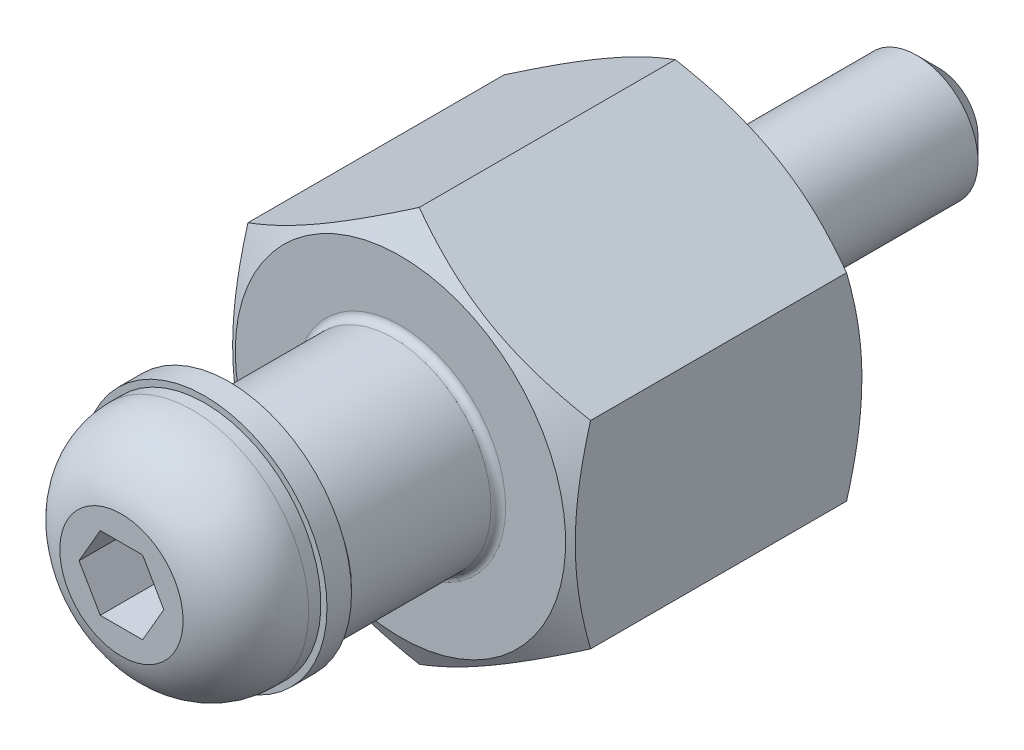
ISO-10303-21;
HEADER;
FILE_DESCRIPTION(('STEP AP214'),'2;1');
FILE_NAME('part.step','',(''),(''),'','','');
FILE_SCHEMA(('AUTOMOTIVE_DESIGN { 1 0 10303 214 1 1 1 1 }'));
ENDSEC;
DATA;
#1=APPLICATION_CONTEXT('core data for automotive mechanical design processes');
#2=APPLICATION_PROTOCOL_DEFINITION('international standard','automotive_design',2000,#1);
#3=PRODUCT_CONTEXT('',#1,'mechanical');
#4=PRODUCT('Part','Part','',(#3));
#5=PRODUCT_RELATED_PRODUCT_CATEGORY('part','',(#4));
#6=PRODUCT_DEFINITION_FORMATION('','',#4);
#7=PRODUCT_DEFINITION_CONTEXT('part definition',#1,'design');
#8=PRODUCT_DEFINITION('design','',#6,#7);
#9=PRODUCT_DEFINITION_SHAPE('','',#8);
#10=(LENGTH_UNIT() NAMED_UNIT(*) SI_UNIT(.MILLI.,.METRE.));
#11=(NAMED_UNIT(*) PLANE_ANGLE_UNIT() SI_UNIT($,.RADIAN.));
#12=(NAMED_UNIT(*) SI_UNIT($,.STERADIAN.) SOLID_ANGLE_UNIT());
#13=UNCERTAINTY_MEASURE_WITH_UNIT(LENGTH_MEASURE(1.E-05),#10,'distance_accuracy_value','');
#14=(GEOMETRIC_REPRESENTATION_CONTEXT(3) GLOBAL_UNCERTAINTY_ASSIGNED_CONTEXT((#13)) GLOBAL_UNIT_ASSIGNED_CONTEXT((#10,
#11,#12)) REPRESENTATION_CONTEXT('',''));
#15=CARTESIAN_POINT('',(0.,0.,0.));
#16=DIRECTION('',(0.,0.,1.));
#17=DIRECTION('',(1.,0.,0.));
#18=AXIS2_PLACEMENT_3D('',#15,#16,#17);
#19=CARTESIAN_POINT('',(0.,-8.88290376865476,18.5));
#20=DIRECTION('',(-0.5,-0.866025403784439,0.));
#21=DIRECTION('',(-0.866025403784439,0.5,0.));
#22=AXIS2_PLACEMENT_3D('',#19,#20,#21);
#23=PLANE('',#22);
#24=DIRECTION('',(0.,0.,-1.));
#25=VECTOR('',#24,1.);
#26=CARTESIAN_POINT('',(-7.,-4.84145188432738,18.5));
#27=LINE('',#26,#25);
#28=CARTESIAN_POINT('',(-7.,-4.84145188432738,11.2304476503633));
#29=VERTEX_POINT('',#28);
#30=CARTESIAN_POINT('',(-7.,-4.84145188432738,0.769552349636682));
#31=VERTEX_POINT('',#30);
#32=EDGE_CURVE('E126',#29,#31,#27,.T.);
#33=ORIENTED_EDGE('',*,*,#32,.T.);
#34=CARTESIAN_POINT('',(-7.0002,-4.84133641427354,0.7696190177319));
#35=CARTESIAN_POINT('',(-6.84633209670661,-4.93017208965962,0.718337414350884));
#36=CARTESIAN_POINT('',(-6.69189049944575,-5.01933898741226,0.669383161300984));
#37=CARTESIAN_POINT('',(-6.38175307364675,-5.19839691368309,0.576770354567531));
#38=CARTESIAN_POINT('',(-6.22605673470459,-5.28828823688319,0.533114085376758));
#39=CARTESIAN_POINT('',(-5.75647483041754,-5.55940147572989,0.41094915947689));
#40=CARTESIAN_POINT('',(-5.4407356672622,-5.74169356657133,0.341463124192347));
#41=CARTESIAN_POINT('',(-4.96823775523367,-6.01449036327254,0.259982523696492));
#42=CARTESIAN_POINT('',(-4.81289077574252,-6.10417998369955,0.236771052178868));
#43=CARTESIAN_POINT('',(-4.50149488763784,-6.28396448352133,0.197848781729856));
#44=CARTESIAN_POINT('',(-4.34544604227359,-6.37405932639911,0.182137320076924));
#45=CARTESIAN_POINT('',(-4.03307732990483,-6.55440548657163,0.158615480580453));
#46=CARTESIAN_POINT('',(-3.87675797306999,-6.64465650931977,0.150796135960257));
#47=CARTESIAN_POINT('',(-3.56398349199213,-6.82523694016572,0.143217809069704));
#48=CARTESIAN_POINT('',(-3.40752837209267,-6.91556634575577,0.14345857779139));
#49=CARTESIAN_POINT('',(-2.97889312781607,-7.16303901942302,0.155197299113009));
#50=CARTESIAN_POINT('',(-2.7068533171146,-7.32010127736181,0.174903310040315));
#51=CARTESIAN_POINT('',(-2.16458055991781,-7.63318259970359,0.237391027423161));
#52=CARTESIAN_POINT('',(-1.89434952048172,-7.7892005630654,0.280194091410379));
#53=CARTESIAN_POINT('',(-1.35098545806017,-8.10291195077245,0.387189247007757));
#54=CARTESIAN_POINT('',(-1.07792099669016,-8.26056579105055,0.451834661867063));
#55=CARTESIAN_POINT('',(-0.535864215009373,-8.57352241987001,0.598553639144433));
#56=CARTESIAN_POINT('',(-0.266864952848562,-8.72882921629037,0.680592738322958));
#57=CARTESIAN_POINT('',(0.000199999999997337,-8.8830192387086,0.769619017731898));
#58=B_SPLINE_CURVE_WITH_KNOTS('',3,(#34,#35,#36,#37,#38,#39,#40,#41,#42,#43,#44,#45,#46,#47,#48,
#49,#50,#51,#52,#53,#54,#55,#56,#57),.UNSPECIFIED.,.F.,.F.,(4,2,2,2,2,2,2,2,2,2,2,4),(0.,
0.554727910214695,1.10969417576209,2.2219327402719,2.76443041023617,3.30688013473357,
3.8487128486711,4.39052882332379,5.33376515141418,6.27787517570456,7.2429241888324,
8.20607866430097),.UNSPECIFIED.);
#59=CARTESIAN_POINT('',(0.,-8.88290376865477,0.769552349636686));
#60=VERTEX_POINT('',#59);
#61=EDGE_CURVE('E29',#31,#60,#58,.T.);
#62=ORIENTED_EDGE('',*,*,#61,.T.);
#63=DIRECTION('',(0.,0.,-1.));
#64=VECTOR('',#63,1.);
#65=CARTESIAN_POINT('',(0.,-8.88290376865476,18.5));
#66=LINE('',#65,#64);
#67=CARTESIAN_POINT('',(0.,-8.88290376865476,11.2304476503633));
#68=VERTEX_POINT('',#67);
#69=EDGE_CURVE('E131',#68,#60,#66,.T.);
#70=ORIENTED_EDGE('',*,*,#69,.F.);
#71=CARTESIAN_POINT('',(-7.0002,-4.84133641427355,11.2303809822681));
#72=CARTESIAN_POINT('',(-6.84633209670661,-4.93017208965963,11.2816625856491));
#73=CARTESIAN_POINT('',(-6.69189049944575,-5.01933898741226,11.330616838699));
#74=CARTESIAN_POINT('',(-6.38175307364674,-5.19839691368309,11.4232296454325));
#75=CARTESIAN_POINT('',(-6.22605673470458,-5.28828823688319,11.4668859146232));
#76=CARTESIAN_POINT('',(-5.75647483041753,-5.55940147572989,11.5890508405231));
#77=CARTESIAN_POINT('',(-5.4407356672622,-5.74169356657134,11.6585368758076));
#78=CARTESIAN_POINT('',(-4.96823775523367,-6.01449036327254,11.7400174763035));
#79=CARTESIAN_POINT('',(-4.81289077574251,-6.10417998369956,11.7632289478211));
#80=CARTESIAN_POINT('',(-4.50149488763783,-6.28396448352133,11.8021512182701));
#81=CARTESIAN_POINT('',(-4.34544604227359,-6.37405932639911,11.8178626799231));
#82=CARTESIAN_POINT('',(-4.03307732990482,-6.55440548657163,11.8413845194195));
#83=CARTESIAN_POINT('',(-3.87675797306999,-6.64465650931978,11.8492038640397));
#84=CARTESIAN_POINT('',(-3.56398349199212,-6.82523694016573,11.8567821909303));
#85=CARTESIAN_POINT('',(-3.40752837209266,-6.91556634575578,11.8565414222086));
#86=CARTESIAN_POINT('',(-2.97889312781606,-7.16303901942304,11.844802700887));
#87=CARTESIAN_POINT('',(-2.7068533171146,-7.32010127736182,11.8250966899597));
#88=CARTESIAN_POINT('',(-2.1645805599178,-7.63318259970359,11.7626089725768));
#89=CARTESIAN_POINT('',(-1.89434952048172,-7.7892005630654,11.7198059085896));
#90=CARTESIAN_POINT('',(-1.35098545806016,-8.10291195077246,11.6128107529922));
#91=CARTESIAN_POINT('',(-1.07792099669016,-8.26056579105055,11.5481653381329));
#92=CARTESIAN_POINT('',(-0.53586421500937,-8.57352241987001,11.4014463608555));
#93=CARTESIAN_POINT('',(-0.26686495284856,-8.72882921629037,11.319407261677));
#94=CARTESIAN_POINT('',(0.000199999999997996,-8.8830192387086,11.2303809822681));
#95=B_SPLINE_CURVE_WITH_KNOTS('',3,(#71,#72,#73,#74,#75,#76,#77,#78,#79,#80,#81,#82,#83,#84,#85,
#86,#87,#88,#89,#90,#91,#92,#93,#94),.UNSPECIFIED.,.F.,.F.,(4,2,2,2,2,2,2,2,2,2,2,4),(0.,
0.554727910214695,1.10969417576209,2.2219327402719,2.76443041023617,3.30688013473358,
3.8487128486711,4.39052882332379,5.33376515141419,6.27787517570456,7.2429241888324,
8.20607866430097),.UNSPECIFIED.);
#96=EDGE_CURVE('E203',#29,#68,#95,.T.);
#97=ORIENTED_EDGE('',*,*,#96,.F.);
#98=EDGE_LOOP('',(#33,#62,#70,#97));
#99=FACE_BOUND('',#98,.T.);
#100=ADVANCED_FACE('F14',(#99),#23,.T.);
#101=CARTESIAN_POINT('',(7.,-4.84145188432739,18.5));
#102=DIRECTION('',(0.5,-0.866025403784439,0.));
#103=DIRECTION('',(-0.866025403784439,-0.5,0.));
#104=AXIS2_PLACEMENT_3D('',#101,#102,#103);
#105=PLANE('',#104);
#106=ORIENTED_EDGE('',*,*,#69,.T.);
#107=CARTESIAN_POINT('',(-0.00020000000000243,-8.88301923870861,0.769619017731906));
#108=CARTESIAN_POINT('',(0.153667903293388,-8.79418356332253,0.718337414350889));
#109=CARTESIAN_POINT('',(0.308109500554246,-8.70501666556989,0.669383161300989));
#110=CARTESIAN_POINT('',(0.618246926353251,-8.52595873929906,0.576770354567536));
#111=CARTESIAN_POINT('',(0.773943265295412,-8.43606741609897,0.533114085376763));
#112=CARTESIAN_POINT('',(1.24352516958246,-8.16495417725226,0.410949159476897));
#113=CARTESIAN_POINT('',(1.5592643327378,-7.98266208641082,0.341463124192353));
#114=CARTESIAN_POINT('',(2.03176224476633,-7.70986528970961,0.259982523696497));
#115=CARTESIAN_POINT('',(2.18710922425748,-7.6201756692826,0.236771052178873));
#116=CARTESIAN_POINT('',(2.49850511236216,-7.44039116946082,0.197848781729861));
#117=CARTESIAN_POINT('',(2.6545539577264,-7.35029632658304,0.182137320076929));
#118=CARTESIAN_POINT('',(2.96692267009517,-7.16995016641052,0.158615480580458));
#119=CARTESIAN_POINT('',(3.12324202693,-7.07969914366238,0.150796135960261));
#120=CARTESIAN_POINT('',(3.43601650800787,-6.89911871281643,0.143217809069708));
#121=CARTESIAN_POINT('',(3.59247162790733,-6.80878930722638,0.143458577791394));
#122=CARTESIAN_POINT('',(4.02110687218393,-6.56131663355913,0.155197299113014));
#123=CARTESIAN_POINT('',(4.2931466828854,-6.40425437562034,0.174903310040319));
#124=CARTESIAN_POINT('',(4.8354194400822,-6.09117305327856,0.237391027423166));
#125=CARTESIAN_POINT('',(5.10565047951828,-5.93515508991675,0.280194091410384));
#126=CARTESIAN_POINT('',(5.64901454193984,-5.6214437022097,0.387189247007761));
#127=CARTESIAN_POINT('',(5.92207900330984,-5.4637898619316,0.451834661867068));
#128=CARTESIAN_POINT('',(6.46413578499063,-5.15083323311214,0.598553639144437));
#129=CARTESIAN_POINT('',(6.73313504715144,-4.99552643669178,0.680592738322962));
#130=CARTESIAN_POINT('',(7.0002,-4.84133641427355,0.769619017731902));
#131=B_SPLINE_CURVE_WITH_KNOTS('',3,(#107,#108,#109,#110,#111,#112,#113,#114,#115,#116,#117,
#118,#119,#120,#121,#122,#123,#124,#125,#126,#127,#128,#129,#130),.UNSPECIFIED.,.F.,.F.,(4,2,2,
2,2,2,2,2,2,2,2,4),(0.,0.554727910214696,1.10969417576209,2.2219327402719,2.76443041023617,
3.30688013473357,3.8487128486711,4.39052882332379,5.33376515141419,6.27787517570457,
7.2429241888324,8.20607866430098),.UNSPECIFIED.);
#132=CARTESIAN_POINT('',(7.,-4.84145188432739,0.769552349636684));
#133=VERTEX_POINT('',#132);
#134=EDGE_CURVE('E254',#60,#133,#131,.T.);
#135=ORIENTED_EDGE('',*,*,#134,.T.);
#136=DIRECTION('',(0.,0.,-1.));
#137=VECTOR('',#136,1.);
#138=CARTESIAN_POINT('',(7.,-4.84145188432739,18.5));
#139=LINE('',#138,#137);
#140=CARTESIAN_POINT('',(7.,-4.84145188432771,11.2304476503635));
#141=VERTEX_POINT('',#140);
#142=EDGE_CURVE('E139',#141,#133,#139,.T.);
#143=ORIENTED_EDGE('',*,*,#142,.F.);
#144=CARTESIAN_POINT('',(-0.000200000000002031,-8.8830192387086,11.2303809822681));
#145=CARTESIAN_POINT('',(0.153667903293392,-8.79418356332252,11.2816625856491));
#146=CARTESIAN_POINT('',(0.308109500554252,-8.70501666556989,11.330616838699));
#147=CARTESIAN_POINT('',(0.618246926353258,-8.52595873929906,11.4232296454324));
#148=CARTESIAN_POINT('',(0.773943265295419,-8.43606741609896,11.4668859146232));
#149=CARTESIAN_POINT('',(1.24352516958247,-8.16495417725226,11.5890508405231));
#150=CARTESIAN_POINT('',(1.55926433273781,-7.98266208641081,11.6585368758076));
#151=CARTESIAN_POINT('',(2.03176224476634,-7.70986528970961,11.7400174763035));
#152=CARTESIAN_POINT('',(2.1871092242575,-7.62017566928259,11.7632289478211));
#153=CARTESIAN_POINT('',(2.49850511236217,-7.44039116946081,11.8021512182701));
#154=CARTESIAN_POINT('',(2.65455395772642,-7.35029632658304,11.8178626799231));
#155=CARTESIAN_POINT('',(2.96692267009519,-7.16995016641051,11.8413845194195));
#156=CARTESIAN_POINT('',(3.12324202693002,-7.07969914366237,11.8492038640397));
#157=CARTESIAN_POINT('',(3.43601650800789,-6.89911871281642,11.8567821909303));
#158=CARTESIAN_POINT('',(3.59247162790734,-6.80878930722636,11.8565414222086));
#159=CARTESIAN_POINT('',(4.02110687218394,-6.5613166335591,11.844802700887));
#160=CARTESIAN_POINT('',(4.29314668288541,-6.40425437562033,11.8250966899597));
#161=CARTESIAN_POINT('',(4.83541944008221,-6.09117305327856,11.7626089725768));
#162=CARTESIAN_POINT('',(5.10565047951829,-5.93515508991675,11.7198059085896));
#163=CARTESIAN_POINT('',(5.64901454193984,-5.62144370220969,11.6128107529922));
#164=CARTESIAN_POINT('',(5.92207900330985,-5.4637898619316,11.5481653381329));
#165=CARTESIAN_POINT('',(6.46413578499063,-5.15083323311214,11.4014463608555));
#166=CARTESIAN_POINT('',(6.73313504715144,-4.99552643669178,11.319407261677));
#167=CARTESIAN_POINT('',(7.0002,-4.84133641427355,11.2303809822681));
#168=B_SPLINE_CURVE_WITH_KNOTS('',3,(#144,#145,#146,#147,#148,#149,#150,#151,#152,#153,#154,
#155,#156,#157,#158,#159,#160,#161,#162,#163,#164,#165,#166,#167),.UNSPECIFIED.,.F.,.F.,(4,2,2,
2,2,2,2,2,2,2,2,4),(0.,0.554727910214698,1.10969417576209,2.22193274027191,2.76443041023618,
3.30688013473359,3.84871284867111,4.3905288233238,5.3337651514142,6.27787517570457,
7.24292418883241,8.20607866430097),.UNSPECIFIED.);
#169=EDGE_CURVE('E196',#68,#141,#168,.T.);
#170=ORIENTED_EDGE('',*,*,#169,.F.);
#171=EDGE_LOOP('',(#106,#135,#143,#170));
#172=FACE_BOUND('',#171,.T.);
#173=ADVANCED_FACE('F264',(#172),#105,.T.);
#174=CARTESIAN_POINT('',(7.,3.24145188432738,18.5));
#175=DIRECTION('',(1.,0.,0.));
#176=DIRECTION('',(0.,-1.,0.));
#177=AXIS2_PLACEMENT_3D('',#174,#175,#176);
#178=PLANE('',#177);
#179=ORIENTED_EDGE('',*,*,#142,.T.);
#180=CARTESIAN_POINT('',(7.,-11.6615815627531,3.56331359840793));
#181=CARTESIAN_POINT('',(7.,-11.3557966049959,3.41495738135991));
#182=CARTESIAN_POINT('',(6.99999999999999,-11.04931031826,3.26802200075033));
#183=CARTESIAN_POINT('',(6.99999999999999,-10.4345621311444,2.97779190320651));
#184=CARTESIAN_POINT('',(6.99999999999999,-10.1262999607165,2.83449775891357));
#185=CARTESIAN_POINT('',(6.99999999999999,-9.50604157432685,2.55162945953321));
#186=CARTESIAN_POINT('',(6.99999999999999,-9.19403416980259,2.41207975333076));
#187=CARTESIAN_POINT('',(6.99999999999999,-8.56753982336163,2.1386834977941));
#188=CARTESIAN_POINT('',(6.99999999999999,-8.25305299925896,2.00483667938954));
#189=CARTESIAN_POINT('',(6.99999999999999,-7.6109273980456,1.74015886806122));
#190=CARTESIAN_POINT('',(7.,-7.28319099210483,1.60956342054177));
#191=CARTESIAN_POINT('',(7.,-6.62388680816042,1.3582425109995));
#192=CARTESIAN_POINT('',(7.,-6.29231860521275,1.23751815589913));
#193=CARTESIAN_POINT('',(7.,-5.62543803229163,1.00910479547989));
#194=CARTESIAN_POINT('',(7.,-5.29013478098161,0.901389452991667));
#195=CARTESIAN_POINT('',(7.,-4.61473051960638,0.702445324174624));
#196=CARTESIAN_POINT('',(7.,-4.27463105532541,0.611211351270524));
#197=CARTESIAN_POINT('',(7.,-3.59127314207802,0.450095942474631));
#198=CARTESIAN_POINT('',(7.,-3.24804279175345,0.380098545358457));
#199=CARTESIAN_POINT('',(7.,-2.73006707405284,0.294057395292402));
#200=CARTESIAN_POINT('',(7.,-2.55687413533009,0.268535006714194));
#201=CARTESIAN_POINT('',(7.,-2.20962543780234,0.224309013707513));
#202=CARTESIAN_POINT('',(7.,-2.03556976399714,0.205604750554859));
#203=CARTESIAN_POINT('',(7.,-1.68910528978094,0.175622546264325));
#204=CARTESIAN_POINT('',(7.,-1.51670463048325,0.164250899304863));
#205=CARTESIAN_POINT('',(7.,-1.17157693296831,0.148808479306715));
#206=CARTESIAN_POINT('',(7.,-0.99884990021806,0.144737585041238));
#207=CARTESIAN_POINT('',(7.,-0.653378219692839,0.143993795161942));
#208=CARTESIAN_POINT('',(7.,-0.480633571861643,0.147320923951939));
#209=CARTESIAN_POINT('',(7.,-0.135438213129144,0.161291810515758));
#210=CARTESIAN_POINT('',(7.,0.0370124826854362,0.171935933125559));
#211=CARTESIAN_POINT('',(7.,0.451285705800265,0.206069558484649));
#212=CARTESIAN_POINT('',(7.,0.692829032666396,0.233020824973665));
#213=CARTESIAN_POINT('',(7.,1.17411541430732,0.299808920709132));
#214=CARTESIAN_POINT('',(7.,1.41385822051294,0.339647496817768));
#215=CARTESIAN_POINT('',(7.,2.13011583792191,0.476381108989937));
#216=CARTESIAN_POINT('',(7.,2.60339153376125,0.59046900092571));
#217=CARTESIAN_POINT('',(7.,3.31107650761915,0.788218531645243));
#218=CARTESIAN_POINT('',(7.,3.54915864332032,0.859491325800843));
#219=CARTESIAN_POINT('',(7.,4.02301033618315,1.00941762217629));
#220=CARTESIAN_POINT('',(7.,4.25877987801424,1.08807117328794));
#221=CARTESIAN_POINT('',(7.,4.7280810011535,1.25149880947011));
#222=CARTESIAN_POINT('',(7.,4.9616132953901,1.33627086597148));
#223=CARTESIAN_POINT('',(7.,5.42674440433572,1.51094025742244));
#224=CARTESIAN_POINT('',(7.,5.65834324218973,1.60083753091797));
#225=CARTESIAN_POINT('',(7.,6.20691960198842,1.81964583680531));
#226=CARTESIAN_POINT('',(7.,6.52313029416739,1.95047589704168));
#227=CARTESIAN_POINT('',(7.,7.15284696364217,2.21850965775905));
#228=CARTESIAN_POINT('',(7.,7.4663527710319,2.35571375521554));
#229=CARTESIAN_POINT('',(7.,8.09116040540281,2.63520861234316));
#230=CARTESIAN_POINT('',(7.,8.40246176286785,2.77750041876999));
#231=CARTESIAN_POINT('',(7.,9.02317855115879,3.06614699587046));
#232=CARTESIAN_POINT('',(7.,9.33259394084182,3.21250185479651));
#233=CARTESIAN_POINT('',(7.,9.95017814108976,3.50866558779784));
#234=CARTESIAN_POINT('',(7.,10.25834523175,3.65847804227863));
#235=CARTESIAN_POINT('',(7.,10.8733478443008,3.96081412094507));
#236=CARTESIAN_POINT('',(7.,11.1801833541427,4.11333776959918));
#237=CARTESIAN_POINT('',(7.,12.098928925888,4.57420935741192));
#238=CARTESIAN_POINT('',(7.,12.7091625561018,4.88589881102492));
#239=CARTESIAN_POINT('',(7.,13.8749184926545,5.48891058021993));
#240=CARTESIAN_POINT('',(7.00000000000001,14.4307039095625,5.77972652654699));
#241=CARTESIAN_POINT('',(7.00000000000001,15.5402135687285,6.36530954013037));
#242=CARTESIAN_POINT('',(7.00000000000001,16.0939377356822,6.66007674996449));
#243=CARTESIAN_POINT('',(7.00000000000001,17.1983827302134,7.25186906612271));
#244=CARTESIAN_POINT('',(7.00000000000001,17.7491076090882,7.54888662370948));
#245=CARTESIAN_POINT('',(7.00000000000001,18.8492408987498,8.14527782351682));
#246=CARTESIAN_POINT('',(7.,19.3986493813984,8.44465133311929));
#247=CARTESIAN_POINT('',(7.,19.9475740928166,8.74490333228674));
#248=B_SPLINE_CURVE_WITH_KNOTS('',3,(#180,#181,#182,#183,#184,#185,#186,#187,#188,#189,#190,
#191,#192,#193,#194,#195,#196,#197,#198,#199,#200,#201,#202,#203,#204,#205,#206,#207,#208,#209,
#210,#211,#212,#213,#214,#215,#216,#217,#218,#219,#220,#221,#222,#223,#224,#225,#226,#227,#228,
#229,#230,#231,#232,#233,#234,#235,#236,#237,#238,#239,#240,#241,#242,#243,#244,#245,#246,#247),
.UNSPECIFIED.,.F.,.F.,(4,2,2,2,2,2,2,2,2,2,2,2,2,2,2,2,2,2,2,2,2,2,2,2,2,2,2,2,2,2,2,2,2,4),(0.,
1.01963297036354,2.03942531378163,3.06475983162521,4.09004591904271,5.14831608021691,
6.20670475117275,7.2629134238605,8.31878913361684,9.36879098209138,9.89386803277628,
10.4188943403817,10.9370707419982,11.4552385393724,11.9734080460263,12.4916033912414,
13.2203185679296,13.9491325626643,15.4075653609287,16.1530677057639,16.8985749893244,
17.6438362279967,18.3890885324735,19.415615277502,20.4422060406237,21.4690092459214,
22.4958347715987,23.5237760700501,24.5517266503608,26.607346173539,28.4891480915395,
30.3710180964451,32.2481523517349,34.1251816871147),.UNSPECIFIED.);
#249=CARTESIAN_POINT('',(7.,3.24145188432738,0.769552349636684));
#250=VERTEX_POINT('',#249);
#251=EDGE_CURVE('E248',#133,#250,#248,.T.);
#252=ORIENTED_EDGE('',*,*,#251,.T.);
#253=DIRECTION('',(0.,0.,-1.));
#254=VECTOR('',#253,1.);
#255=CARTESIAN_POINT('',(7.,3.24145188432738,18.5));
#256=LINE('',#255,#254);
#257=CARTESIAN_POINT('',(7.,3.24145188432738,11.2304476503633));
#258=VERTEX_POINT('',#257);
#259=EDGE_CURVE('E142',#258,#250,#256,.T.);
#260=ORIENTED_EDGE('',*,*,#259,.F.);
#261=CARTESIAN_POINT('',(7.,-11.8252402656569,8.3570894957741));
#262=CARTESIAN_POINT('',(7.,-11.5179968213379,8.50680343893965));
#263=CARTESIAN_POINT('',(6.99999999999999,-11.2100659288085,8.65512988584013));
#264=CARTESIAN_POINT('',(6.99999999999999,-10.5924641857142,8.94823052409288));
#265=CARTESIAN_POINT('',(6.99999999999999,-10.2827930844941,9.09300418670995));
#266=CARTESIAN_POINT('',(6.99999999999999,-9.65983065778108,9.37891426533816));
#267=CARTESIAN_POINT('',(6.99999999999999,-9.34652889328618,9.52002801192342));
#268=CARTESIAN_POINT('',(6.99999999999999,-8.71749157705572,9.79670127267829));
#269=CARTESIAN_POINT('',(6.99999999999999,-8.40175613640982,9.93226103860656));
#270=CARTESIAN_POINT('',(6.99999999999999,-7.75662256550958,10.2008308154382));
#271=CARTESIAN_POINT('',(7.,-7.42712346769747,10.333599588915));
#272=CARTESIAN_POINT('',(7.,-6.76433446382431,10.5894927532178));
#273=CARTESIAN_POINT('',(7.,-6.43104414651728,10.7126160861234));
#274=CARTESIAN_POINT('',(7.,-5.76070886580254,10.9461100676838));
#275=CARTESIAN_POINT('',(7.,-5.42367248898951,11.0565051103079));
#276=CARTESIAN_POINT('',(7.,-4.74478010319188,11.2611140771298));
#277=CARTESIAN_POINT('',(7.,-4.40292559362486,11.3553329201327));
#278=CARTESIAN_POINT('',(7.,-3.71602933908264,11.5226788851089));
#279=CARTESIAN_POINT('',(7.,-3.37101701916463,11.5959235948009));
#280=CARTESIAN_POINT('',(7.,-2.85022569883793,11.6869675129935));
#281=CARTESIAN_POINT('',(7.,-2.67607165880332,11.7141794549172));
#282=CARTESIAN_POINT('',(7.,-2.32684240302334,11.7617996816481));
#283=CARTESIAN_POINT('',(7.,-2.15176728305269,11.7822086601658));
#284=CARTESIAN_POINT('',(7.,-1.80329059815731,11.81555138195));
#285=CARTESIAN_POINT('',(7.,-1.62989838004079,11.8285823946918));
#286=CARTESIAN_POINT('',(7.,-1.28271767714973,11.8472933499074));
#287=CARTESIAN_POINT('',(7.,-1.10892919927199,11.8529734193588));
#288=CARTESIAN_POINT('',(7.,-0.761266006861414,11.8568462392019));
#289=CARTESIAN_POINT('',(7.,-0.587391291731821,11.8550389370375));
#290=CARTESIAN_POINT('',(7.,-0.239876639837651,11.8439829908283));
#291=CARTESIAN_POINT('',(7.,-0.0662367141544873,11.8347340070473));
#292=CARTESIAN_POINT('',(7.,0.345964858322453,11.8041446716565));
#293=CARTESIAN_POINT('',(7.,0.584291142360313,11.7795579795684));
#294=CARTESIAN_POINT('',(7.,1.05927389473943,11.7176689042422));
#295=CARTESIAN_POINT('',(7.,1.2959301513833,11.6803649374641));
#296=CARTESIAN_POINT('',(7.,2.00305957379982,11.5513472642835));
#297=CARTESIAN_POINT('',(7.,2.47046212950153,11.4425473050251));
#298=CARTESIAN_POINT('',(7.,3.16975920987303,11.2525739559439));
#299=CARTESIAN_POINT('',(7.,3.40524233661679,11.1838396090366));
#300=CARTESIAN_POINT('',(7.,3.87392424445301,11.0389105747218));
#301=CARTESIAN_POINT('',(7.,4.10712300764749,10.9627158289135));
#302=CARTESIAN_POINT('',(7.,4.57130662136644,10.8041150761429));
#303=CARTESIAN_POINT('',(7.,4.80229206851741,10.7217107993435));
#304=CARTESIAN_POINT('',(7.,5.2623248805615,10.5516926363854));
#305=CARTESIAN_POINT('',(7.,5.49137229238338,10.4640788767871));
#306=CARTESIAN_POINT('',(7.,6.11684977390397,10.2179701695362));
#307=CARTESIAN_POINT('',(7.,6.51154127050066,10.0550605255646));
#308=CARTESIAN_POINT('',(7.,7.29678221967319,9.71951152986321));
#309=CARTESIAN_POINT('',(7.,7.68733117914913,9.54687103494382));
#310=CARTESIAN_POINT('',(7.,8.46525895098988,9.19420400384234));
#311=CARTESIAN_POINT('',(7.,8.85263641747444,9.01417450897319));
#312=CARTESIAN_POINT('',(7.,9.62471557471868,8.64852834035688));
#313=CARTESIAN_POINT('',(7.,10.0094173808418,8.46291190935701));
#314=CARTESIAN_POINT('',(7.,10.7773250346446,8.08701466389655));
#315=CARTESIAN_POINT('',(7.,11.1605273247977,7.89672659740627));
#316=CARTESIAN_POINT('',(7.,11.9252005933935,7.5127005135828));
#317=CARTESIAN_POINT('',(7.,12.3066715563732,7.31896246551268));
#318=CARTESIAN_POINT('',(7.,13.068107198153,6.92876899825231));
#319=CARTESIAN_POINT('',(7.,13.4480722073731,6.73231422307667));
#320=CARTESIAN_POINT('',(7.,14.2068329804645,6.33715827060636));
#321=CARTESIAN_POINT('',(7.00000000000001,14.5856287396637,6.13845708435));
#322=CARTESIAN_POINT('',(7.00000000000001,15.6385377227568,5.58288077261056));
#323=CARTESIAN_POINT('',(7.00000000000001,16.3115949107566,5.2240047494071));
#324=CARTESIAN_POINT('',(7.00000000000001,17.6554853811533,4.50201748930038));
#325=CARTESIAN_POINT('',(7.00000000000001,18.3263185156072,4.13890597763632));
#326=CARTESIAN_POINT('',(7.00000000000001,19.6639671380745,3.41079943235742));
#327=CARTESIAN_POINT('',(7.00000000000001,20.330788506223,3.04581519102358));
#328=CARTESIAN_POINT('',(7.00000000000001,21.6630423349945,2.31344867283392));
#329=CARTESIAN_POINT('',(7.00000000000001,22.3284749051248,1.9460665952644));
#330=CARTESIAN_POINT('',(7.,22.9934226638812,1.57781542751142));
#331=B_SPLINE_CURVE_WITH_KNOTS('',3,(#261,#262,#263,#264,#265,#266,#267,#268,#269,#270,#271,
#272,#273,#274,#275,#276,#277,#278,#279,#280,#281,#282,#283,#284,#285,#286,#287,#288,#289,#290,
#291,#292,#293,#294,#295,#296,#297,#298,#299,#300,#301,#302,#303,#304,#305,#306,#307,#308,#309,
#310,#311,#312,#313,#314,#315,#316,#317,#318,#319,#320,#321,#322,#323,#324,#325,#326,#327,#328,
#329,#330),.UNSPECIFIED.,.F.,.F.,(4,2,2,2,2,2,2,2,2,2,2,2,2,2,2,2,2,2,2,2,2,2,2,2,2,2,2,2,2,2,2,
2,2,2,4),(0.,1.02534835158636,2.05084838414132,3.08164929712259,4.11240343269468,
5.17801349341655,6.2437402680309,7.30738936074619,8.3707144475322,9.42795594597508,
9.95664563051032,10.485281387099,11.0067749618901,11.528259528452,12.049747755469,
12.571259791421,13.2896310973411,14.0080918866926,15.4457065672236,16.181568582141,
16.9174363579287,17.6530998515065,18.388745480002,19.6695196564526,20.9504446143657,
22.2318875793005,23.5132749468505,24.7967959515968,26.0803283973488,27.3635616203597,
28.6467999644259,30.9350469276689,33.2234431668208,35.5039589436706,37.7842875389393),.UNSPECIFIED.);
#332=EDGE_CURVE('E188',#141,#258,#331,.T.);
#333=ORIENTED_EDGE('',*,*,#332,.F.);
#334=EDGE_LOOP('',(#179,#252,#260,#333));
#335=FACE_BOUND('',#334,.T.);
#336=ADVANCED_FACE('F267',(#335),#178,.T.);
#337=CARTESIAN_POINT('',(0.,7.28290376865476,18.5));
#338=DIRECTION('',(0.5,0.866025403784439,0.));
#339=DIRECTION('',(0.866025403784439,-0.5,0.));
#340=AXIS2_PLACEMENT_3D('',#337,#338,#339);
#341=PLANE('',#340);
#342=ORIENTED_EDGE('',*,*,#259,.T.);
#343=CARTESIAN_POINT('',(7.0002,3.24133641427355,0.7696190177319));
#344=CARTESIAN_POINT('',(6.84633209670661,3.33017208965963,0.718337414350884));
#345=CARTESIAN_POINT('',(6.69189049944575,3.41933898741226,0.669383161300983));
#346=CARTESIAN_POINT('',(6.38175307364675,3.59839691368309,0.576770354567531));
#347=CARTESIAN_POINT('',(6.22605673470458,3.68828823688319,0.533114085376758));
#348=CARTESIAN_POINT('',(5.75647483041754,3.95940147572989,0.410949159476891));
#349=CARTESIAN_POINT('',(5.4407356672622,4.14169356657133,0.341463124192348));
#350=CARTESIAN_POINT('',(4.96823775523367,4.41449036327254,0.259982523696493));
#351=CARTESIAN_POINT('',(4.81289077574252,4.50417998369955,0.236771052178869));
#352=CARTESIAN_POINT('',(4.50149488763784,4.68396448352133,0.197848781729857));
#353=CARTESIAN_POINT('',(4.34544604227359,4.77405932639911,0.182137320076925));
#354=CARTESIAN_POINT('',(4.03307732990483,4.95440548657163,0.158615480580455));
#355=CARTESIAN_POINT('',(3.87675797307,5.04465650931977,0.150796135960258));
#356=CARTESIAN_POINT('',(3.56398349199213,5.22523694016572,0.143217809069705));
#357=CARTESIAN_POINT('',(3.40752837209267,5.31556634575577,0.14345857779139));
#358=CARTESIAN_POINT('',(2.97889312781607,5.56303901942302,0.155197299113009));
#359=CARTESIAN_POINT('',(2.7068533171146,5.72010127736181,0.174903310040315));
#360=CARTESIAN_POINT('',(2.16458055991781,6.03318259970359,0.237391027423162));
#361=CARTESIAN_POINT('',(1.89434952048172,6.1892005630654,0.28019409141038));
#362=CARTESIAN_POINT('',(1.35098545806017,6.50291195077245,0.387189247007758));
#363=CARTESIAN_POINT('',(1.07792099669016,6.66056579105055,0.451834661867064));
#364=CARTESIAN_POINT('',(0.535864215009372,6.97352241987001,0.598553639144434));
#365=CARTESIAN_POINT('',(0.266864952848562,7.12882921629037,0.680592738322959));
#366=CARTESIAN_POINT('',(-0.000199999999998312,7.2830192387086,0.7696190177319));
#367=B_SPLINE_CURVE_WITH_KNOTS('',3,(#343,#344,#345,#346,#347,#348,#349,#350,#351,#352,#353,
#354,#355,#356,#357,#358,#359,#360,#361,#362,#363,#364,#365,#366),.UNSPECIFIED.,.F.,.F.,(4,2,2,
2,2,2,2,2,2,2,2,4),(0.,0.554727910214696,1.10969417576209,2.2219327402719,2.76443041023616,
3.30688013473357,3.84871284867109,4.39052882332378,5.33376515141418,6.27787517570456,
7.2429241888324,8.20607866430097),.UNSPECIFIED.);
#368=CARTESIAN_POINT('',(0.,7.28290376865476,0.769552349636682));
#369=VERTEX_POINT('',#368);
#370=EDGE_CURVE('E120',#250,#369,#367,.T.);
#371=ORIENTED_EDGE('',*,*,#370,.T.);
#372=DIRECTION('',(0.,0.,-1.));
#373=VECTOR('',#372,1.);
#374=CARTESIAN_POINT('',(0.,7.28290376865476,18.5));
#375=LINE('',#374,#373);
#376=CARTESIAN_POINT('',(0.,7.28290376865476,11.2304476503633));
#377=VERTEX_POINT('',#376);
#378=EDGE_CURVE('E119',#377,#369,#375,.T.);
#379=ORIENTED_EDGE('',*,*,#378,.F.);
#380=CARTESIAN_POINT('',(7.0002,3.24133641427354,11.2303809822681));
#381=CARTESIAN_POINT('',(6.84633209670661,3.33017208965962,11.2816625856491));
#382=CARTESIAN_POINT('',(6.69189049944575,3.41933898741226,11.330616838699));
#383=CARTESIAN_POINT('',(6.38175307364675,3.59839691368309,11.4232296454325));
#384=CARTESIAN_POINT('',(6.22605673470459,3.68828823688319,11.4668859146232));
#385=CARTESIAN_POINT('',(5.75647483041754,3.95940147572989,11.5890508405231));
#386=CARTESIAN_POINT('',(5.4407356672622,4.14169356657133,11.6585368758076));
#387=CARTESIAN_POINT('',(4.96823775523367,4.41449036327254,11.7400174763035));
#388=CARTESIAN_POINT('',(4.81289077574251,4.50417998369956,11.7632289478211));
#389=CARTESIAN_POINT('',(4.50149488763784,4.68396448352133,11.8021512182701));
#390=CARTESIAN_POINT('',(4.34544604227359,4.77405932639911,11.8178626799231));
#391=CARTESIAN_POINT('',(4.03307732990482,4.95440548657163,11.8413845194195));
#392=CARTESIAN_POINT('',(3.87675797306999,5.04465650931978,11.8492038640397));
#393=CARTESIAN_POINT('',(3.56398349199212,5.22523694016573,11.8567821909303));
#394=CARTESIAN_POINT('',(3.40752837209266,5.31556634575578,11.8565414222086));
#395=CARTESIAN_POINT('',(2.97889312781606,5.56303901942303,11.844802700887));
#396=CARTESIAN_POINT('',(2.7068533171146,5.72010127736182,11.8250966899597));
#397=CARTESIAN_POINT('',(2.1645805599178,6.03318259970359,11.7626089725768));
#398=CARTESIAN_POINT('',(1.89434952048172,6.1892005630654,11.7198059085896));
#399=CARTESIAN_POINT('',(1.35098545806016,6.50291195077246,11.6128107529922));
#400=CARTESIAN_POINT('',(1.07792099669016,6.66056579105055,11.5481653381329));
#401=CARTESIAN_POINT('',(0.535864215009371,6.97352241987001,11.4014463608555));
#402=CARTESIAN_POINT('',(0.266864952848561,7.12882921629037,11.319407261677));
#403=CARTESIAN_POINT('',(-0.000199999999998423,7.2830192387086,11.2303809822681));
#404=B_SPLINE_CURVE_WITH_KNOTS('',3,(#380,#381,#382,#383,#384,#385,#386,#387,#388,#389,#390,
#391,#392,#393,#394,#395,#396,#397,#398,#399,#400,#401,#402,#403),.UNSPECIFIED.,.F.,.F.,(4,2,2,
2,2,2,2,2,2,2,2,4),(0.,0.554727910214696,1.10969417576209,2.22193274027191,2.76443041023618,
3.30688013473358,3.84871284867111,4.3905288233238,5.33376515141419,6.27787517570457,
7.24292418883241,8.20607866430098),.UNSPECIFIED.);
#405=EDGE_CURVE('E155',#258,#377,#404,.T.);
#406=ORIENTED_EDGE('',*,*,#405,.F.);
#407=EDGE_LOOP('',(#342,#371,#379,#406));
#408=FACE_BOUND('',#407,.T.);
#409=ADVANCED_FACE('F165',(#408),#341,.T.);
#410=CARTESIAN_POINT('',(-7.,3.24145188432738,18.5));
#411=DIRECTION('',(-0.5,0.866025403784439,0.));
#412=DIRECTION('',(0.866025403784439,0.5,0.));
#413=AXIS2_PLACEMENT_3D('',#410,#411,#412);
#414=PLANE('',#413);
#415=ORIENTED_EDGE('',*,*,#378,.T.);
#416=CARTESIAN_POINT('',(0.000200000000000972,7.2830192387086,0.7696190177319));
#417=CARTESIAN_POINT('',(-0.15366790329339,7.19418356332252,0.718337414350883));
#418=CARTESIAN_POINT('',(-0.308109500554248,7.10501666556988,0.669383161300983));
#419=CARTESIAN_POINT('',(-0.618246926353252,6.92595873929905,0.57677035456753));
#420=CARTESIAN_POINT('',(-0.773943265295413,6.83606741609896,0.533114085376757));
#421=CARTESIAN_POINT('',(-1.24352516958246,6.56495417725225,0.410949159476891));
#422=CARTESIAN_POINT('',(-1.5592643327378,6.38266208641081,0.341463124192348));
#423=CARTESIAN_POINT('',(-2.03176224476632,6.1098652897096,0.259982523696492));
#424=CARTESIAN_POINT('',(-2.18710922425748,6.02017566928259,0.236771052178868));
#425=CARTESIAN_POINT('',(-2.49850511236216,5.84039116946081,0.197848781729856));
#426=CARTESIAN_POINT('',(-2.6545539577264,5.75029632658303,0.182137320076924));
#427=CARTESIAN_POINT('',(-2.96692267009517,5.56995016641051,0.158615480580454));
#428=CARTESIAN_POINT('',(-3.12324202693,5.47969914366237,0.150796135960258));
#429=CARTESIAN_POINT('',(-3.43601650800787,5.29911871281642,0.143217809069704));
#430=CARTESIAN_POINT('',(-3.59247162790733,5.20878930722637,0.143458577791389));
#431=CARTESIAN_POINT('',(-4.02110687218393,4.96131663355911,0.155197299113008));
#432=CARTESIAN_POINT('',(-4.29314668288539,4.80425437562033,0.174903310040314));
#433=CARTESIAN_POINT('',(-4.83541944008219,4.49117305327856,0.237391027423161));
#434=CARTESIAN_POINT('',(-5.10565047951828,4.33515508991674,0.28019409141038));
#435=CARTESIAN_POINT('',(-5.64901454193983,4.02144370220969,0.387189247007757));
#436=CARTESIAN_POINT('',(-5.92207900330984,3.86378986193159,0.451834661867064));
#437=CARTESIAN_POINT('',(-6.46413578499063,3.55083323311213,0.598553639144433));
#438=CARTESIAN_POINT('',(-6.73313504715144,3.39552643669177,0.680592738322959));
#439=CARTESIAN_POINT('',(-7.0002,3.24133641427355,0.769619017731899));
#440=B_SPLINE_CURVE_WITH_KNOTS('',3,(#416,#417,#418,#419,#420,#421,#422,#423,#424,#425,#426,
#427,#428,#429,#430,#431,#432,#433,#434,#435,#436,#437,#438,#439),.UNSPECIFIED.,.F.,.F.,(4,2,2,
2,2,2,2,2,2,2,2,4),(0.,0.554727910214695,1.10969417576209,2.2219327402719,2.76443041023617,
3.30688013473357,3.84871284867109,4.39052882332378,5.33376515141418,6.27787517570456,
7.2429241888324,8.20607866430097),.UNSPECIFIED.);
#441=CARTESIAN_POINT('',(-7.,3.24145188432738,0.76955234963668));
#442=VERTEX_POINT('',#441);
#443=EDGE_CURVE('E104',#369,#442,#440,.T.);
#444=ORIENTED_EDGE('',*,*,#443,.T.);
#445=DIRECTION('',(0.,0.,-1.));
#446=VECTOR('',#445,1.);
#447=CARTESIAN_POINT('',(-7.,3.24145188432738,18.5));
#448=LINE('',#447,#446);
#449=CARTESIAN_POINT('',(-7.,3.24145188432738,11.2304476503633));
#450=VERTEX_POINT('',#449);
#451=EDGE_CURVE('E117',#450,#442,#448,.T.);
#452=ORIENTED_EDGE('',*,*,#451,.F.);
#453=CARTESIAN_POINT('',(0.000200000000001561,7.2830192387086,11.2303809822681));
#454=CARTESIAN_POINT('',(-0.15366790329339,7.19418356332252,11.2816625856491));
#455=CARTESIAN_POINT('',(-0.308109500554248,7.10501666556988,11.330616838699));
#456=CARTESIAN_POINT('',(-0.618246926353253,6.92595873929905,11.4232296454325));
#457=CARTESIAN_POINT('',(-0.773943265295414,6.83606741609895,11.4668859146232));
#458=CARTESIAN_POINT('',(-1.24352516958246,6.56495417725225,11.5890508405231));
#459=CARTESIAN_POINT('',(-1.5592643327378,6.38266208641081,11.6585368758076));
#460=CARTESIAN_POINT('',(-2.03176224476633,6.1098652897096,11.7400174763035));
#461=CARTESIAN_POINT('',(-2.18710922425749,6.02017566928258,11.7632289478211));
#462=CARTESIAN_POINT('',(-2.49850511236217,5.84039116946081,11.8021512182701));
#463=CARTESIAN_POINT('',(-2.65455395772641,5.75029632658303,11.8178626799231));
#464=CARTESIAN_POINT('',(-2.96692267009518,5.5699501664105,11.8413845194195));
#465=CARTESIAN_POINT('',(-3.12324202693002,5.47969914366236,11.8492038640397));
#466=CARTESIAN_POINT('',(-3.43601650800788,5.29911871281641,11.8567821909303));
#467=CARTESIAN_POINT('',(-3.59247162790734,5.20878930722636,11.8565414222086));
#468=CARTESIAN_POINT('',(-4.02110687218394,4.9613166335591,11.844802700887));
#469=CARTESIAN_POINT('',(-4.29314668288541,4.80425437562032,11.8250966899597));
#470=CARTESIAN_POINT('',(-4.8354194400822,4.49117305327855,11.7626089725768));
#471=CARTESIAN_POINT('',(-5.10565047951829,4.33515508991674,11.7198059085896));
#472=CARTESIAN_POINT('',(-5.64901454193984,4.02144370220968,11.6128107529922));
#473=CARTESIAN_POINT('',(-5.92207900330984,3.86378986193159,11.5481653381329));
#474=CARTESIAN_POINT('',(-6.46413578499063,3.55083323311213,11.4014463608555));
#475=CARTESIAN_POINT('',(-6.73313504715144,3.39552643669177,11.319407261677));
#476=CARTESIAN_POINT('',(-7.0002,3.24133641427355,11.2303809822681));
#477=B_SPLINE_CURVE_WITH_KNOTS('',3,(#453,#454,#455,#456,#457,#458,#459,#460,#461,#462,#463,
#464,#465,#466,#467,#468,#469,#470,#471,#472,#473,#474,#475,#476),.UNSPECIFIED.,.F.,.F.,(4,2,2,
2,2,2,2,2,2,2,2,4),(0.,0.554727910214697,1.1096941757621,2.22193274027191,2.76443041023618,
3.30688013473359,3.84871284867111,4.39052882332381,5.3337651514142,6.27787517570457,
7.24292418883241,8.20607866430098),.UNSPECIFIED.);
#478=EDGE_CURVE('E145',#377,#450,#477,.T.);
#479=ORIENTED_EDGE('',*,*,#478,.F.);
#480=EDGE_LOOP('',(#415,#444,#452,#479));
#481=FACE_BOUND('',#480,.T.);
#482=ADVANCED_FACE('F115',(#481),#414,.T.);
#483=CARTESIAN_POINT('',(-7.,-4.84145188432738,18.5));
#484=DIRECTION('',(-1.,0.,0.));
#485=DIRECTION('',(0.,1.,0.));
#486=AXIS2_PLACEMENT_3D('',#483,#484,#485);
#487=PLANE('',#486);
#488=ORIENTED_EDGE('',*,*,#451,.T.);
#489=CARTESIAN_POINT('',(-7.,-11.6615815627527,3.56331359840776));
#490=CARTESIAN_POINT('',(-7.,-11.3557966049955,3.41495738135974));
#491=CARTESIAN_POINT('',(-7.,-11.0493103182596,3.26802200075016));
#492=CARTESIAN_POINT('',(-7.,-10.4345621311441,2.97779190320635));
#493=CARTESIAN_POINT('',(-7.,-10.1262999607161,2.83449775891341));
#494=CARTESIAN_POINT('',(-7.,-9.5060415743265,2.55162945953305));
#495=CARTESIAN_POINT('',(-7.,-9.19403416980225,2.41207975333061));
#496=CARTESIAN_POINT('',(-7.,-8.56753982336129,2.13868349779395));
#497=CARTESIAN_POINT('',(-7.,-8.25305299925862,2.0048366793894));
#498=CARTESIAN_POINT('',(-7.,-7.61092739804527,1.74015886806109));
#499=CARTESIAN_POINT('',(-7.,-7.2831909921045,1.60956342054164));
#500=CARTESIAN_POINT('',(-7.,-6.6238868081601,1.35824251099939));
#501=CARTESIAN_POINT('',(-7.,-6.29231860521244,1.23751815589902));
#502=CARTESIAN_POINT('',(-7.,-5.62543803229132,1.00910479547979));
#503=CARTESIAN_POINT('',(-7.,-5.29013478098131,0.901389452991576));
#504=CARTESIAN_POINT('',(-7.,-4.61473051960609,0.702445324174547));
#505=CARTESIAN_POINT('',(-7.,-4.27463105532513,0.611211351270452));
#506=CARTESIAN_POINT('',(-7.,-3.59127314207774,0.450095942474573));
#507=CARTESIAN_POINT('',(-7.,-3.24804279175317,0.380098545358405));
#508=CARTESIAN_POINT('',(-7.,-2.73006707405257,0.294057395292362));
#509=CARTESIAN_POINT('',(-7.,-2.55687413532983,0.268535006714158));
#510=CARTESIAN_POINT('',(-7.,-2.20962543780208,0.224309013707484));
#511=CARTESIAN_POINT('',(-7.,-2.03556976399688,0.205604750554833));
#512=CARTESIAN_POINT('',(-7.,-1.68910528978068,0.175622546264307));
#513=CARTESIAN_POINT('',(-7.,-1.516704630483,0.164250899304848));
#514=CARTESIAN_POINT('',(-7.,-1.17157693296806,0.148808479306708));
#515=CARTESIAN_POINT('',(-7.,-0.998849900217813,0.144737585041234));
#516=CARTESIAN_POINT('',(-7.,-0.653378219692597,0.143993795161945));
#517=CARTESIAN_POINT('',(-7.,-0.480633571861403,0.147320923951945));
#518=CARTESIAN_POINT('',(-7.,-0.135438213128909,0.16129181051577));
#519=CARTESIAN_POINT('',(-7.,0.0370124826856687,0.171935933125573));
#520=CARTESIAN_POINT('',(-7.,0.451285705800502,0.206069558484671));
#521=CARTESIAN_POINT('',(-7.,0.692829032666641,0.233020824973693));
#522=CARTESIAN_POINT('',(-7.,1.17411541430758,0.299808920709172));
#523=CARTESIAN_POINT('',(-7.,1.41385822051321,0.339647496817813));
#524=CARTESIAN_POINT('',(-7.,2.13011583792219,0.476381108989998));
#525=CARTESIAN_POINT('',(-7.,2.60339153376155,0.590469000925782));
#526=CARTESIAN_POINT('',(-7.,3.31107650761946,0.788218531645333));
#527=CARTESIAN_POINT('',(-7.,3.54915864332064,0.859491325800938));
#528=CARTESIAN_POINT('',(-7.,4.02301033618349,1.0094176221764));
#529=CARTESIAN_POINT('',(-7.,4.25877987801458,1.08807117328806));
#530=CARTESIAN_POINT('',(-6.99999999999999,4.72808100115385,1.25149880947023));
#531=CARTESIAN_POINT('',(-6.99999999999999,4.96161329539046,1.33627086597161));
#532=CARTESIAN_POINT('',(-7.,5.42674440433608,1.51094025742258));
#533=CARTESIAN_POINT('',(-7.,5.6583432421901,1.60083753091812));
#534=CARTESIAN_POINT('',(-7.,6.20691960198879,1.81964583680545));
#535=CARTESIAN_POINT('',(-7.,6.52313029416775,1.95047589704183));
#536=CARTESIAN_POINT('',(-6.99999999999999,7.15284696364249,2.21850965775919));
#537=CARTESIAN_POINT('',(-6.99999999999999,7.46635277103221,2.35571375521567));
#538=CARTESIAN_POINT('',(-6.99999999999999,8.0911604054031,2.63520861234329));
#539=CARTESIAN_POINT('',(-6.99999999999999,8.40246176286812,2.77750041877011));
#540=CARTESIAN_POINT('',(-6.99999999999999,9.02317855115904,3.06614699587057));
#541=CARTESIAN_POINT('',(-6.99999999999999,9.33259394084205,3.21250185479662));
#542=CARTESIAN_POINT('',(-6.99999999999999,9.95017814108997,3.50866558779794));
#543=CARTESIAN_POINT('',(-6.99999999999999,10.2583452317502,3.65847804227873));
#544=CARTESIAN_POINT('',(-6.99999999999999,10.873347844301,3.96081412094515));
#545=CARTESIAN_POINT('',(-6.99999999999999,11.1801833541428,4.11333776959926));
#546=CARTESIAN_POINT('',(-6.99999999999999,12.0989289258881,4.57420935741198));
#547=CARTESIAN_POINT('',(-6.99999999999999,12.7091625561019,4.88589881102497));
#548=CARTESIAN_POINT('',(-6.99999999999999,13.8749184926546,5.48891058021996));
#549=CARTESIAN_POINT('',(-6.99999999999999,14.4307039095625,5.779726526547));
#550=CARTESIAN_POINT('',(-6.99999999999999,15.5402135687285,6.36530954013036));
#551=CARTESIAN_POINT('',(-6.99999999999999,16.0939377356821,6.66007674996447));
#552=CARTESIAN_POINT('',(-6.99999999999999,17.1983827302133,7.25186906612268));
#553=CARTESIAN_POINT('',(-6.99999999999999,17.7491076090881,7.54888662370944));
#554=CARTESIAN_POINT('',(-6.99999999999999,18.8492408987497,8.14527782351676));
#555=CARTESIAN_POINT('',(-6.99999999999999,19.3986493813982,8.44465133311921));
#556=CARTESIAN_POINT('',(-7.,19.9475740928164,8.74490333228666));
#557=B_SPLINE_CURVE_WITH_KNOTS('',3,(#489,#490,#491,#492,#493,#494,#495,#496,#497,#498,#499,
#500,#501,#502,#503,#504,#505,#506,#507,#508,#509,#510,#511,#512,#513,#514,#515,#516,#517,#518,
#519,#520,#521,#522,#523,#524,#525,#526,#527,#528,#529,#530,#531,#532,#533,#534,#535,#536,#537,
#538,#539,#540,#541,#542,#543,#544,#545,#546,#547,#548,#549,#550,#551,#552,#553,#554,#555,#556),
.UNSPECIFIED.,.F.,.F.,(4,2,2,2,2,2,2,2,2,2,2,2,2,2,2,2,2,2,2,2,2,2,2,2,2,2,2,2,2,2,2,2,2,4),(0.,
1.01963297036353,2.0394253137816,3.06475983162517,4.09004591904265,5.14831608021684,
6.20670475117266,7.26291342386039,8.31878913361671,9.36879098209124,9.89386803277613,
10.4188943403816,10.937070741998,11.4552385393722,11.9734080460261,12.4916033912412,
13.2203185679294,13.9491325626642,15.4075653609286,16.1530677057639,16.8985749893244,
17.6438362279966,18.3890885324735,19.415615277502,20.4422060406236,21.4690092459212,
22.4958347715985,23.5237760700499,24.5517266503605,26.6073461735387,28.4891480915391,
30.3710180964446,32.2481523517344,34.1251816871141),.UNSPECIFIED.);
#558=EDGE_CURVE('E100',#442,#31,#557,.F.);
#559=ORIENTED_EDGE('',*,*,#558,.T.);
#560=ORIENTED_EDGE('',*,*,#32,.F.);
#561=CARTESIAN_POINT('',(-7.,-11.8252402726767,8.3570894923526));
#562=CARTESIAN_POINT('',(-7.,-11.5179968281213,8.50680343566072));
#563=CARTESIAN_POINT('',(-7.,-11.2100659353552,8.65512988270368));
#564=CARTESIAN_POINT('',(-7.,-10.5924641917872,8.94823052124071));
#565=CARTESIAN_POINT('',(-7.,-10.2827930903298,9.09300418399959));
#566=CARTESIAN_POINT('',(-7.,-9.65983066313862,9.37891426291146));
#567=CARTESIAN_POINT('',(-7.,-9.34652889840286,9.52002800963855));
#568=CARTESIAN_POINT('',(-7.,-8.71749158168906,9.79670127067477));
#569=CARTESIAN_POINT('',(-7.,-8.40175614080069,9.93226103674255));
#570=CARTESIAN_POINT('',(-7.,-7.75662256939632,10.2008308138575));
#571=CARTESIAN_POINT('',(-7.,-7.42712347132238,10.3335995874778));
#572=CARTESIAN_POINT('',(-7.,-6.7643344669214,10.5894927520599));
#573=CARTESIAN_POINT('',(-7.,-6.43104414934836,10.7126160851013));
#574=CARTESIAN_POINT('',(-7.,-5.7607088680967,10.9461100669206));
#575=CARTESIAN_POINT('',(-7.,-5.42367249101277,11.0565051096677));
#576=CARTESIAN_POINT('',(-7.,-4.74478010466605,11.2611140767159));
#577=CARTESIAN_POINT('',(-7.,-4.40292559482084,11.355332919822));
#578=CARTESIAN_POINT('',(-7.,-3.71602933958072,11.5226788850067));
#579=CARTESIAN_POINT('',(-7.,-3.37101701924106,11.5959235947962));
#580=CARTESIAN_POINT('',(-7.,-2.85022569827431,11.6869675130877));
#581=CARTESIAN_POINT('',(-7.,-2.67607165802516,11.7141794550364));
#582=CARTESIAN_POINT('',(-7.,-2.32684240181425,11.7617996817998));
#583=CARTESIAN_POINT('',(-7.,-2.15176728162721,11.782208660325));
#584=CARTESIAN_POINT('',(-7.,-1.80329059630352,11.8155513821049));
#585=CARTESIAN_POINT('',(-7.,-1.62989837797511,11.8285823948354));
#586=CARTESIAN_POINT('',(-7.,-1.28271767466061,11.8472933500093));
#587=CARTESIAN_POINT('',(-7.,-1.10892919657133,11.8529734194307));
#588=CARTESIAN_POINT('',(-7.,-0.761266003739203,11.856846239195));
#589=CARTESIAN_POINT('',(-7.,-0.5873912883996,11.855038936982));
#590=CARTESIAN_POINT('',(-7.,-0.239876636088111,11.8439829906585));
#591=CARTESIAN_POINT('',(-7.,-0.0662367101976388,11.8347340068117));
#592=CARTESIAN_POINT('',(-7.,0.34596486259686,11.8041446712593));
#593=CARTESIAN_POINT('',(-7.,0.584291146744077,11.7795579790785));
#594=CARTESIAN_POINT('',(-7.,1.05927389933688,11.7176689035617));
#595=CARTESIAN_POINT('',(-7.,1.29593015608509,11.680364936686));
#596=CARTESIAN_POINT('',(-7.,2.00305957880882,11.5513472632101));
#597=CARTESIAN_POINT('',(-7.,2.47046213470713,11.4425473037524));
#598=CARTESIAN_POINT('',(-7.,3.16975921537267,11.2525739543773));
#599=CARTESIAN_POINT('',(-7.,3.4052423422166,11.1838396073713));
#600=CARTESIAN_POINT('',(-7.,3.87392425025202,11.0389105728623));
#601=CARTESIAN_POINT('',(-7.,4.10712301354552,10.9627158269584));
#602=CARTESIAN_POINT('',(-6.99999999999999,4.57130662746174,10.8041150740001));
#603=CARTESIAN_POINT('',(-6.99999999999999,4.80229207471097,10.7217107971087));
#604=CARTESIAN_POINT('',(-7.,5.26232488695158,10.5516926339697));
#605=CARTESIAN_POINT('',(-7.,5.49137229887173,10.4640788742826));
#606=CARTESIAN_POINT('',(-7.,6.11684978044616,10.2179701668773));
#607=CARTESIAN_POINT('',(-7.,6.51154127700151,10.0550605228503));
#608=CARTESIAN_POINT('',(-6.99999999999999,7.29678222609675,9.71951152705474));
#609=CARTESIAN_POINT('',(-6.99999999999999,7.68733118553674,9.54687103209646));
#610=CARTESIAN_POINT('',(-6.99999999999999,8.46525895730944,9.19420400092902));
#611=CARTESIAN_POINT('',(-6.99999999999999,8.85263642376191,9.01417450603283));
#612=CARTESIAN_POINT('',(-6.99999999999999,9.62471558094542,8.64852833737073));
#613=CARTESIAN_POINT('',(-6.99999999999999,10.0094173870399,8.46291190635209));
#614=CARTESIAN_POINT('',(-6.99999999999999,10.7773250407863,8.08701466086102));
#615=CARTESIAN_POINT('',(-6.99999999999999,11.1605273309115,7.89672659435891));
#616=CARTESIAN_POINT('',(-6.99999999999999,11.9252005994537,7.51270051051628));
#617=CARTESIAN_POINT('',(-6.99999999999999,12.3066715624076,7.31896246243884));
#618=CARTESIAN_POINT('',(-6.99999999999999,13.0681072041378,6.92876899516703));
#619=CARTESIAN_POINT('',(-6.99999999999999,13.4480722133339,6.73231421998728));
#620=CARTESIAN_POINT('',(-6.99999999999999,14.2068329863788,6.33715826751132));
#621=CARTESIAN_POINT('',(-6.99999999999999,14.5856287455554,6.13845708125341));
#622=CARTESIAN_POINT('',(-6.99999999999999,15.6385377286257,5.58288076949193));
#623=CARTESIAN_POINT('',(-6.99999999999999,16.3115949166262,5.22400474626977));
#624=CARTESIAN_POINT('',(-6.99999999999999,17.6554853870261,4.50201748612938));
#625=CARTESIAN_POINT('',(-6.99999999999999,18.3263185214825,4.13890597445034));
#626=CARTESIAN_POINT('',(-6.99999999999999,19.6639671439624,3.41079942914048));
#627=CARTESIAN_POINT('',(-6.99999999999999,20.3307885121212,3.04581518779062));
#628=CARTESIAN_POINT('',(-6.99999999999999,21.6630423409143,2.31344866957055));
#629=CARTESIAN_POINT('',(-6.99999999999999,22.3284749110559,1.94606659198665));
#630=CARTESIAN_POINT('',(-7.,22.9934226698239,1.57781542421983));
#631=B_SPLINE_CURVE_WITH_KNOTS('',3,(#561,#562,#563,#564,#565,#566,#567,#568,#569,#570,#571,
#572,#573,#574,#575,#576,#577,#578,#579,#580,#581,#582,#583,#584,#585,#586,#587,#588,#589,#590,
#591,#592,#593,#594,#595,#596,#597,#598,#599,#600,#601,#602,#603,#604,#605,#606,#607,#608,#609,
#610,#611,#612,#613,#614,#615,#616,#617,#618,#619,#620,#621,#622,#623,#624,#625,#626,#627,#628,
#629,#630),.UNSPECIFIED.,.F.,.F.,(4,2,2,2,2,2,2,2,2,2,2,2,2,2,2,2,2,2,2,2,2,2,2,2,2,2,2,2,2,2,2,
2,2,2,4),(0.,1.02534835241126,2.05084838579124,3.08164929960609,4.1124034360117,
5.17801349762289,6.24374027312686,7.30738936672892,8.37071445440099,9.42795595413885,
9.95664563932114,10.4852813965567,11.0067749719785,11.5282595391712,12.0497477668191,
12.5712598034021,13.2896311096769,14.0080918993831,15.4457065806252,16.1815685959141,
16.9174363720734,17.6530998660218,18.3887454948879,19.6695196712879,20.9504446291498,
22.2318875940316,23.5132749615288,24.7967959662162,26.0803284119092,27.3635616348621,
28.6467999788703,30.9350469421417,33.2234431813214,35.5039589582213,37.7842875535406),.UNSPECIFIED.);
#632=EDGE_CURVE('E124',#450,#29,#631,.F.);
#633=ORIENTED_EDGE('',*,*,#632,.F.);
#634=EDGE_LOOP('',(#488,#559,#560,#633));
#635=FACE_BOUND('',#634,.T.);
#636=ADVANCED_FACE('F123',(#635),#487,.T.);
#637=CARTESIAN_POINT('',(1.73205080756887,0.,20.4));
#638=DIRECTION('',(0.,0.,1.));
#639=DIRECTION('',(0.,-1.,0.));
#640=AXIS2_PLACEMENT_3D('',#637,#638,#639);
#641=PLANE('',#640);
#642=DIRECTION('',(0.5,0.866025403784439,0.));
#643=VECTOR('',#642,1.);
#644=CARTESIAN_POINT('',(0.866025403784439,-1.5,20.4));
#645=LINE('',#644,#643);
#646=CARTESIAN_POINT('',(0.866025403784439,-1.5,20.4));
#647=VERTEX_POINT('',#646);
#648=CARTESIAN_POINT('',(1.73205080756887,0.,20.4));
#649=VERTEX_POINT('',#648);
#650=EDGE_CURVE('E652',#647,#649,#645,.T.);
#651=ORIENTED_EDGE('',*,*,#650,.T.);
#652=DIRECTION('',(-0.5,0.866025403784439,0.));
#653=VECTOR('',#652,1.);
#654=CARTESIAN_POINT('',(1.73205080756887,0.,20.4));
#655=LINE('',#654,#653);
#656=CARTESIAN_POINT('',(0.866025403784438,1.5,20.4));
#657=VERTEX_POINT('',#656);
#658=EDGE_CURVE('E649',#649,#657,#655,.T.);
#659=ORIENTED_EDGE('',*,*,#658,.T.);
#660=DIRECTION('',(-1.,0.,0.));
#661=VECTOR('',#660,1.);
#662=CARTESIAN_POINT('',(0.866025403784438,1.5,20.4));
#663=LINE('',#662,#661);
#664=CARTESIAN_POINT('',(-0.866025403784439,1.5,20.4));
#665=VERTEX_POINT('',#664);
#666=EDGE_CURVE('E646',#657,#665,#663,.T.);
#667=ORIENTED_EDGE('',*,*,#666,.T.);
#668=DIRECTION('',(-0.5,-0.866025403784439,0.));
#669=VECTOR('',#668,1.);
#670=CARTESIAN_POINT('',(-0.866025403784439,1.5,20.4));
#671=LINE('',#670,#669);
#672=CARTESIAN_POINT('',(-1.73205080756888,0.,20.4));
#673=VERTEX_POINT('',#672);
#674=EDGE_CURVE('E643',#665,#673,#671,.T.);
#675=ORIENTED_EDGE('',*,*,#674,.T.);
#676=DIRECTION('',(0.5,-0.866025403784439,0.));
#677=VECTOR('',#676,1.);
#678=CARTESIAN_POINT('',(-1.73205080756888,0.,20.4));
#679=LINE('',#678,#677);
#680=CARTESIAN_POINT('',(-0.866025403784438,-1.5,20.4));
#681=VERTEX_POINT('',#680);
#682=EDGE_CURVE('E640',#673,#681,#679,.T.);
#683=ORIENTED_EDGE('',*,*,#682,.T.);
#684=DIRECTION('',(1.,0.,0.));
#685=VECTOR('',#684,1.);
#686=CARTESIAN_POINT('',(-0.866025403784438,-1.5,20.4));
#687=LINE('',#686,#685);
#688=EDGE_CURVE('E631',#681,#647,#687,.T.);
#689=ORIENTED_EDGE('',*,*,#688,.T.);
#690=EDGE_LOOP('',(#651,#659,#667,#675,#683,#689));
#691=FACE_BOUND('',#690,.T.);
#692=ADVANCED_FACE('F345',(#691),#641,.T.);
#693=CARTESIAN_POINT('',(0.866025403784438,1.5,20.4));
#694=DIRECTION('',(0.,1.,0.));
#695=DIRECTION('',(-1.,0.,0.));
#696=AXIS2_PLACEMENT_3D('',#693,#694,#695);
#697=PLANE('',#696);
#698=DIRECTION('',(-1.,0.,0.));
#699=VECTOR('',#698,1.);
#700=CARTESIAN_POINT('',(0.866025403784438,1.5,23.4));
#701=LINE('',#700,#699);
#702=CARTESIAN_POINT('',(0.866025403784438,1.5,23.4));
#703=VERTEX_POINT('',#702);
#704=CARTESIAN_POINT('',(-0.866025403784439,1.5,23.4));
#705=VERTEX_POINT('',#704);
#706=EDGE_CURVE('E664',#703,#705,#701,.T.);
#707=ORIENTED_EDGE('',*,*,#706,.T.);
#708=DIRECTION('',(0.,0.,1.));
#709=VECTOR('',#708,1.);
#710=CARTESIAN_POINT('',(-0.866025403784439,1.5,20.4));
#711=LINE('',#710,#709);
#712=EDGE_CURVE('E633',#665,#705,#711,.T.);
#713=ORIENTED_EDGE('',*,*,#712,.F.);
#714=ORIENTED_EDGE('',*,*,#666,.F.);
#715=DIRECTION('',(0.,0.,1.));
#716=VECTOR('',#715,1.);
#717=CARTESIAN_POINT('',(0.866025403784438,1.5,20.4));
#718=LINE('',#717,#716);
#719=EDGE_CURVE('E630',#657,#703,#718,.T.);
#720=ORIENTED_EDGE('',*,*,#719,.T.);
#721=EDGE_LOOP('',(#707,#713,#714,#720));
#722=FACE_BOUND('',#721,.T.);
#723=ADVANCED_FACE('F348',(#722),#697,.F.);
#724=CARTESIAN_POINT('',(-0.866025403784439,1.5,20.4));
#725=DIRECTION('',(-0.866025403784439,0.5,0.));
#726=DIRECTION('',(-0.5,-0.866025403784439,0.));
#727=AXIS2_PLACEMENT_3D('',#724,#725,#726);
#728=PLANE('',#727);
#729=DIRECTION('',(-0.5,-0.866025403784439,0.));
#730=VECTOR('',#729,1.);
#731=CARTESIAN_POINT('',(-0.866025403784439,1.5,23.4));
#732=LINE('',#731,#730);
#733=CARTESIAN_POINT('',(-1.73205080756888,0.,23.4));
#734=VERTEX_POINT('',#733);
#735=EDGE_CURVE('E661',#705,#734,#732,.T.);
#736=ORIENTED_EDGE('',*,*,#735,.T.);
#737=DIRECTION('',(0.,0.,1.));
#738=VECTOR('',#737,1.);
#739=CARTESIAN_POINT('',(-1.73205080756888,0.,20.4));
#740=LINE('',#739,#738);
#741=EDGE_CURVE('E635',#673,#734,#740,.T.);
#742=ORIENTED_EDGE('',*,*,#741,.F.);
#743=ORIENTED_EDGE('',*,*,#674,.F.);
#744=ORIENTED_EDGE('',*,*,#712,.T.);
#745=EDGE_LOOP('',(#736,#742,#743,#744));
#746=FACE_BOUND('',#745,.T.);
#747=ADVANCED_FACE('F358',(#746),#728,.F.);
#748=CARTESIAN_POINT('',(-1.73205080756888,0.,20.4));
#749=DIRECTION('',(-0.866025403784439,-0.5,0.));
#750=DIRECTION('',(0.5,-0.866025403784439,0.));
#751=AXIS2_PLACEMENT_3D('',#748,#749,#750);
#752=PLANE('',#751);
#753=DIRECTION('',(0.5,-0.866025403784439,0.));
#754=VECTOR('',#753,1.);
#755=CARTESIAN_POINT('',(-1.73205080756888,0.,23.4));
#756=LINE('',#755,#754);
#757=CARTESIAN_POINT('',(-0.866025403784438,-1.5,23.4));
#758=VERTEX_POINT('',#757);
#759=EDGE_CURVE('E658',#734,#758,#756,.T.);
#760=ORIENTED_EDGE('',*,*,#759,.T.);
#761=DIRECTION('',(0.,0.,1.));
#762=VECTOR('',#761,1.);
#763=CARTESIAN_POINT('',(-0.866025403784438,-1.5,20.4));
#764=LINE('',#763,#762);
#765=EDGE_CURVE('E405',#681,#758,#764,.T.);
#766=ORIENTED_EDGE('',*,*,#765,.F.);
#767=ORIENTED_EDGE('',*,*,#682,.F.);
#768=ORIENTED_EDGE('',*,*,#741,.T.);
#769=EDGE_LOOP('',(#760,#766,#767,#768));
#770=FACE_BOUND('',#769,.T.);
#771=ADVANCED_FACE('F354',(#770),#752,.F.);
#772=CARTESIAN_POINT('',(-0.866025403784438,-1.5,20.4));
#773=DIRECTION('',(0.,-1.,0.));
#774=DIRECTION('',(1.,0.,0.));
#775=AXIS2_PLACEMENT_3D('',#772,#773,#774);
#776=PLANE('',#775);
#777=DIRECTION('',(1.,0.,0.));
#778=VECTOR('',#777,1.);
#779=CARTESIAN_POINT('',(-0.866025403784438,-1.5,23.4));
#780=LINE('',#779,#778);
#781=CARTESIAN_POINT('',(0.866025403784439,-1.5,23.4));
#782=VERTEX_POINT('',#781);
#783=EDGE_CURVE('E655',#758,#782,#780,.T.);
#784=ORIENTED_EDGE('',*,*,#783,.T.);
#785=DIRECTION('',(0.,0.,1.));
#786=VECTOR('',#785,1.);
#787=CARTESIAN_POINT('',(0.866025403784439,-1.5,20.4));
#788=LINE('',#787,#786);
#789=EDGE_CURVE('E400',#647,#782,#788,.T.);
#790=ORIENTED_EDGE('',*,*,#789,.F.);
#791=ORIENTED_EDGE('',*,*,#688,.F.);
#792=ORIENTED_EDGE('',*,*,#765,.T.);
#793=EDGE_LOOP('',(#784,#790,#791,#792));
#794=FACE_BOUND('',#793,.T.);
#795=ADVANCED_FACE('F350',(#794),#776,.F.);
#796=CARTESIAN_POINT('',(0.866025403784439,-1.5,20.4));
#797=DIRECTION('',(0.866025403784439,-0.5,0.));
#798=DIRECTION('',(0.5,0.866025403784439,0.));
#799=AXIS2_PLACEMENT_3D('',#796,#797,#798);
#800=PLANE('',#799);
#801=DIRECTION('',(0.5,0.866025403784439,0.));
#802=VECTOR('',#801,1.);
#803=CARTESIAN_POINT('',(0.866025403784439,-1.5,23.4));
#804=LINE('',#803,#802);
#805=CARTESIAN_POINT('',(1.73205080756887,0.,23.4));
#806=VERTEX_POINT('',#805);
#807=EDGE_CURVE('E37',#782,#806,#804,.T.);
#808=ORIENTED_EDGE('',*,*,#807,.T.);
#809=DIRECTION('',(0.,0.,1.));
#810=VECTOR('',#809,1.);
#811=CARTESIAN_POINT('',(1.73205080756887,0.,20.4));
#812=LINE('',#811,#810);
#813=EDGE_CURVE('E408',#649,#806,#812,.T.);
#814=ORIENTED_EDGE('',*,*,#813,.F.);
#815=ORIENTED_EDGE('',*,*,#650,.F.);
#816=ORIENTED_EDGE('',*,*,#789,.T.);
#817=EDGE_LOOP('',(#808,#814,#815,#816));
#818=FACE_BOUND('',#817,.T.);
#819=ADVANCED_FACE('F353',(#818),#800,.F.);
#820=CARTESIAN_POINT('',(1.73205080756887,0.,20.4));
#821=DIRECTION('',(0.866025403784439,0.5,0.));
#822=DIRECTION('',(-0.5,0.866025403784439,0.));
#823=AXIS2_PLACEMENT_3D('',#820,#821,#822);
#824=PLANE('',#823);
#825=DIRECTION('',(-0.5,0.866025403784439,0.));
#826=VECTOR('',#825,1.);
#827=CARTESIAN_POINT('',(1.73205080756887,0.,23.4));
#828=LINE('',#827,#826);
#829=EDGE_CURVE('E667',#806,#703,#828,.T.);
#830=ORIENTED_EDGE('',*,*,#829,.T.);
#831=ORIENTED_EDGE('',*,*,#719,.F.);
#832=ORIENTED_EDGE('',*,*,#658,.F.);
#833=ORIENTED_EDGE('',*,*,#813,.T.);
#834=EDGE_LOOP('',(#830,#831,#832,#833));
#835=FACE_BOUND('',#834,.T.);
#836=ADVANCED_FACE('F366',(#835),#824,.F.);
#837=CARTESIAN_POINT('',(0.,0.,23.4));
#838=DIRECTION('',(0.,0.,-1.));
#839=DIRECTION('',(0.,1.,0.));
#840=AXIS2_PLACEMENT_3D('',#837,#838,#839);
#841=PLANE('',#840);
#842=ORIENTED_EDGE('',*,*,#829,.F.);
#843=ORIENTED_EDGE('',*,*,#807,.F.);
#844=ORIENTED_EDGE('',*,*,#783,.F.);
#845=ORIENTED_EDGE('',*,*,#759,.F.);
#846=ORIENTED_EDGE('',*,*,#735,.F.);
#847=ORIENTED_EDGE('',*,*,#706,.F.);
#848=EDGE_LOOP('',(#842,#843,#844,#845,#846,#847));
#849=FACE_BOUND('',#848,.T.);
#850=CARTESIAN_POINT('',(0.,0.,23.4));
#851=DIRECTION('',(0.,0.,1.));
#852=DIRECTION('',(0.,-1.,0.));
#853=AXIS2_PLACEMENT_3D('',#850,#851,#852);
#854=CIRCLE('',#853,2.51811457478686);
#855=CARTESIAN_POINT('',(0.,-2.51811457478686,23.4));
#856=VERTEX_POINT('',#855);
#857=EDGE_CURVE('E399',#856,#856,#854,.T.);
#858=ORIENTED_EDGE('',*,*,#857,.T.);
#859=EDGE_LOOP('',(#858));
#860=FACE_BOUND('',#859,.T.);
#861=ADVANCED_FACE('F369',(#849,#860),#841,.F.);
#862=CARTESIAN_POINT('',(0.,0.,20.5));
#863=DIRECTION('',(0.,0.,1.));
#864=DIRECTION('',(0.,-1.,0.));
#865=AXIS2_PLACEMENT_3D('',#862,#863,#864);
#866=DEGENERATE_TOROIDAL_SURFACE('',#865,1.75,3.,.T.);
#867=ORIENTED_EDGE('',*,*,#857,.F.);
#868=EDGE_LOOP('',(#867));
#869=FACE_BOUND('',#868,.T.);
#870=CARTESIAN_POINT('',(0.,0.,20.5));
#871=DIRECTION('',(0.,0.,1.));
#872=DIRECTION('',(0.,-1.,0.));
#873=AXIS2_PLACEMENT_3D('',#870,#871,#872);
#874=CIRCLE('',#873,4.75);
#875=CARTESIAN_POINT('',(0.,-4.75,20.5));
#876=VERTEX_POINT('',#875);
#877=EDGE_CURVE('E403',#876,#876,#874,.T.);
#878=ORIENTED_EDGE('',*,*,#877,.T.);
#879=EDGE_LOOP('',(#878));
#880=FACE_BOUND('',#879,.T.);
#881=ADVANCED_FACE('F378',(#869,#880),#866,.T.);
#882=CARTESIAN_POINT('',(0.,0.,23.4));
#883=DIRECTION('',(0.,0.,1.));
#884=DIRECTION('',(0.,-1.,0.));
#885=AXIS2_PLACEMENT_3D('',#882,#883,#884);
#886=CYLINDRICAL_SURFACE('',#885,4.75);
#887=ORIENTED_EDGE('',*,*,#877,.F.);
#888=EDGE_LOOP('',(#887));
#889=FACE_BOUND('',#888,.T.);
#890=CARTESIAN_POINT('',(0.,0.,20.));
#891=DIRECTION('',(0.,0.,1.));
#892=DIRECTION('',(0.,-1.,0.));
#893=AXIS2_PLACEMENT_3D('',#890,#891,#892);
#894=CIRCLE('',#893,4.75);
#895=CARTESIAN_POINT('',(0.,-4.75,20.));
#896=VERTEX_POINT('',#895);
#897=EDGE_CURVE('E413',#896,#896,#894,.T.);
#898=ORIENTED_EDGE('',*,*,#897,.T.);
#899=EDGE_LOOP('',(#898));
#900=FACE_BOUND('',#899,.T.);
#901=ADVANCED_FACE('F337',(#889,#900),#886,.T.);
#902=CARTESIAN_POINT('',(0.,0.,23.4));
#903=DIRECTION('',(0.,0.,1.));
#904=DIRECTION('',(0.,-1.,0.));
#905=AXIS2_PLACEMENT_3D('',#902,#903,#904);
#906=CYLINDRICAL_SURFACE('',#905,2.5);
#907=CARTESIAN_POINT('',(0.,0.,20.));
#908=DIRECTION('',(0.,0.,1.));
#909=DIRECTION('',(0.,-1.,0.));
#910=AXIS2_PLACEMENT_3D('',#907,#908,#909);
#911=CIRCLE('',#910,2.5);
#912=CARTESIAN_POINT('',(0.,-2.5,20.));
#913=VERTEX_POINT('',#912);
#914=EDGE_CURVE('E398',#913,#913,#911,.T.);
#915=ORIENTED_EDGE('',*,*,#914,.F.);
#916=EDGE_LOOP('',(#915));
#917=FACE_BOUND('',#916,.T.);
#918=CARTESIAN_POINT('',(0.,0.,18.5));
#919=DIRECTION('',(0.,0.,-1.));
#920=DIRECTION('',(-1.,0.,0.));
#921=AXIS2_PLACEMENT_3D('',#918,#919,#920);
#922=CIRCLE('',#921,2.5);
#923=CARTESIAN_POINT('',(-2.5,0.,18.5));
#924=VERTEX_POINT('',#923);
#925=EDGE_CURVE('E134',#924,#924,#922,.T.);
#926=ORIENTED_EDGE('',*,*,#925,.F.);
#927=EDGE_LOOP('',(#926));
#928=FACE_BOUND('',#927,.T.);
#929=ADVANCED_FACE('F177',(#917,#928),#906,.T.);
#930=CARTESIAN_POINT('',(0.,2.5,20.));
#931=DIRECTION('',(0.,0.,1.));
#932=DIRECTION('',(0.,-1.,0.));
#933=AXIS2_PLACEMENT_3D('',#930,#931,#932);
#934=PLANE('',#933);
#935=CARTESIAN_POINT('',(0.,0.,20.));
#936=DIRECTION('',(0.,0.,1.));
#937=DIRECTION('',(0.,1.,0.));
#938=AXIS2_PLACEMENT_3D('',#935,#936,#937);
#939=CIRCLE('',#938,2.65);
#940=CARTESIAN_POINT('',(0.,2.65,20.));
#941=VERTEX_POINT('',#940);
#942=EDGE_CURVE('E395',#941,#941,#939,.F.);
#943=ORIENTED_EDGE('',*,*,#942,.T.);
#944=EDGE_LOOP('',(#943));
#945=FACE_BOUND('',#944,.T.);
#946=ORIENTED_EDGE('',*,*,#914,.T.);
#947=EDGE_LOOP('',(#946));
#948=FACE_BOUND('',#947,.T.);
#949=ADVANCED_FACE('F343',(#945,#948),#934,.F.);
#950=CARTESIAN_POINT('',(0.,0.,19.));
#951=DIRECTION('',(0.,0.,1.));
#952=DIRECTION('',(-1.,0.,0.));
#953=AXIS2_PLACEMENT_3D('',#950,#951,#952);
#954=CYLINDRICAL_SURFACE('',#953,5.);
#955=CARTESIAN_POINT('',(0.,0.,19.));
#956=DIRECTION('',(0.,0.,-1.));
#957=DIRECTION('',(1.,0.,0.));
#958=AXIS2_PLACEMENT_3D('',#955,#956,#957);
#959=CIRCLE('',#958,5.);
#960=CARTESIAN_POINT('',(5.,0.,19.));
#961=VERTEX_POINT('',#960);
#962=EDGE_CURVE('E671',#961,#961,#959,.T.);
#963=ORIENTED_EDGE('',*,*,#962,.F.);
#964=EDGE_LOOP('',(#963));
#965=FACE_BOUND('',#964,.T.);
#966=CARTESIAN_POINT('',(0.,0.,20.));
#967=DIRECTION('',(0.,0.,-1.));
#968=DIRECTION('',(1.,0.,0.));
#969=AXIS2_PLACEMENT_3D('',#966,#967,#968);
#970=CIRCLE('',#969,5.);
#971=CARTESIAN_POINT('',(5.,0.,20.));
#972=VERTEX_POINT('',#971);
#973=EDGE_CURVE('E673',#972,#972,#970,.T.);
#974=ORIENTED_EDGE('',*,*,#973,.T.);
#975=EDGE_LOOP('',(#974));
#976=FACE_BOUND('',#975,.T.);
#977=ADVANCED_FACE('F332',(#965,#976),#954,.T.);
#978=CARTESIAN_POINT('',(0.,0.,20.));
#979=DIRECTION('',(0.,0.,-1.));
#980=DIRECTION('',(1.,0.,0.));
#981=AXIS2_PLACEMENT_3D('',#978,#979,#980);
#982=PLANE('',#981);
#983=ORIENTED_EDGE('',*,*,#973,.F.);
#984=EDGE_LOOP('',(#983));
#985=FACE_BOUND('',#984,.T.);
#986=ORIENTED_EDGE('',*,*,#897,.F.);
#987=EDGE_LOOP('',(#986));
#988=FACE_BOUND('',#987,.T.);
#989=ADVANCED_FACE('F333',(#985,#988),#982,.F.);
#990=CARTESIAN_POINT('',(0.,0.,19.));
#991=DIRECTION('',(0.,0.,-1.));
#992=DIRECTION('',(1.,0.,0.));
#993=AXIS2_PLACEMENT_3D('',#990,#991,#992);
#994=PLANE('',#993);
#995=ORIENTED_EDGE('',*,*,#962,.T.);
#996=EDGE_LOOP('',(#995));
#997=FACE_BOUND('',#996,.T.);
#998=CARTESIAN_POINT('',(0.,0.,19.));
#999=DIRECTION('',(0.,0.,-1.));
#1000=DIRECTION('',(1.,0.,0.));
#1001=AXIS2_PLACEMENT_3D('',#998,#999,#1000);
#1002=CIRCLE('',#1001,2.65);
#1003=CARTESIAN_POINT('',(2.65,0.,19.));
#1004=VERTEX_POINT('',#1003);
#1005=EDGE_CURVE('E163',#1004,#1004,#1002,.T.);
#1006=ORIENTED_EDGE('',*,*,#1005,.F.);
#1007=EDGE_LOOP('',(#1006));
#1008=FACE_BOUND('',#1007,.T.);
#1009=ADVANCED_FACE('F330',(#997,#1008),#994,.T.);
#1010=CARTESIAN_POINT('',(0.,0.,19.));
#1011=DIRECTION('',(0.,0.,1.));
#1012=DIRECTION('',(-1.,0.,0.));
#1013=AXIS2_PLACEMENT_3D('',#1010,#1011,#1012);
#1014=CYLINDRICAL_SURFACE('',#1013,2.65);
#1015=ORIENTED_EDGE('',*,*,#1005,.T.);
#1016=EDGE_LOOP('',(#1015));
#1017=FACE_BOUND('',#1016,.T.);
#1018=ORIENTED_EDGE('',*,*,#942,.F.);
#1019=EDGE_LOOP('',(#1018));
#1020=FACE_BOUND('',#1019,.T.);
#1021=ADVANCED_FACE('F241',(#1017,#1020),#1014,.F.);
#1022=CARTESIAN_POINT('',(0.,9.2,12.));
#1023=DIRECTION('',(0.,0.,1.));
#1024=DIRECTION('',(1.,0.,0.));
#1025=AXIS2_PLACEMENT_3D('',#1022,#1023,#1024);
#1026=PLANE('',#1025);
#1027=CARTESIAN_POINT('',(0.,-0.8,12.));
#1028=DIRECTION('',(0.,0.,-1.));
#1029=DIRECTION('',(-1.,0.,0.));
#1030=AXIS2_PLACEMENT_3D('',#1027,#1028,#1029);
#1031=CIRCLE('',#1030,6.75);
#1032=CARTESIAN_POINT('',(-6.75,-0.8,12.));
#1033=VERTEX_POINT('',#1032);
#1034=EDGE_CURVE('E290',#1033,#1033,#1031,.T.);
#1035=ORIENTED_EDGE('',*,*,#1034,.F.);
#1036=EDGE_LOOP('',(#1035));
#1037=FACE_BOUND('',#1036,.T.);
#1038=CARTESIAN_POINT('',(0.,-0.8,12.));
#1039=DIRECTION('',(0.,0.,1.));
#1040=DIRECTION('',(1.,0.,0.));
#1041=AXIS2_PLACEMENT_3D('',#1038,#1039,#1040);
#1042=CIRCLE('',#1041,4.3);
#1043=CARTESIAN_POINT('',(4.3,-0.8,12.));
#1044=VERTEX_POINT('',#1043);
#1045=EDGE_CURVE('E149',#1044,#1044,#1042,.F.);
#1046=ORIENTED_EDGE('',*,*,#1045,.T.);
#1047=EDGE_LOOP('',(#1046));
#1048=FACE_BOUND('',#1047,.T.);
#1049=ADVANCED_FACE('F175',(#1037,#1048),#1026,.T.);
#1050=CARTESIAN_POINT('',(0.,-0.8,12.));
#1051=DIRECTION('',(0.,0.,-1.));
#1052=DIRECTION('',(-1.,0.,0.));
#1053=AXIS2_PLACEMENT_3D('',#1050,#1051,#1052);
#1054=CONICAL_SURFACE('',#1053,6.75,1.0471975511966);
#1055=ORIENTED_EDGE('',*,*,#478,.T.);
#1056=ORIENTED_EDGE('',*,*,#632,.T.);
#1057=ORIENTED_EDGE('',*,*,#96,.T.);
#1058=ORIENTED_EDGE('',*,*,#169,.T.);
#1059=ORIENTED_EDGE('',*,*,#332,.T.);
#1060=ORIENTED_EDGE('',*,*,#405,.T.);
#1061=EDGE_LOOP('',(#1055,#1056,#1057,#1058,#1059,#1060));
#1062=FACE_BOUND('',#1061,.T.);
#1063=ORIENTED_EDGE('',*,*,#1034,.T.);
#1064=EDGE_LOOP('',(#1063));
#1065=FACE_BOUND('',#1064,.T.);
#1066=ADVANCED_FACE('F169',(#1062,#1065),#1054,.T.);
#1067=CARTESIAN_POINT('',(0.,-0.8,12.3));
#1068=DIRECTION('',(0.,0.,1.));
#1069=DIRECTION('',(1.,0.,0.));
#1070=AXIS2_PLACEMENT_3D('',#1067,#1068,#1069);
#1071=TOROIDAL_SURFACE('',#1070,4.3,0.3);
#1072=CARTESIAN_POINT('',(0.,-0.8,12.3));
#1073=DIRECTION('',(0.,0.,1.));
#1074=DIRECTION('',(1.,0.,0.));
#1075=AXIS2_PLACEMENT_3D('',#1072,#1073,#1074);
#1076=CIRCLE('',#1075,4.);
#1077=CARTESIAN_POINT('',(4.,-0.8,12.3));
#1078=VERTEX_POINT('',#1077);
#1079=EDGE_CURVE('E152',#1078,#1078,#1076,.T.);
#1080=ORIENTED_EDGE('',*,*,#1079,.F.);
#1081=EDGE_LOOP('',(#1080));
#1082=FACE_BOUND('',#1081,.T.);
#1083=ORIENTED_EDGE('',*,*,#1045,.F.);
#1084=EDGE_LOOP('',(#1083));
#1085=FACE_BOUND('',#1084,.T.);
#1086=ADVANCED_FACE('F174',(#1082,#1085),#1071,.F.);
#1087=CARTESIAN_POINT('',(0.,-0.8,0.));
#1088=DIRECTION('',(0.,0.,-1.));
#1089=DIRECTION('',(-1.,0.,0.));
#1090=AXIS2_PLACEMENT_3D('',#1087,#1088,#1089);
#1091=CYLINDRICAL_SURFACE('',#1090,4.);
#1092=ORIENTED_EDGE('',*,*,#1079,.T.);
#1093=EDGE_LOOP('',(#1092));
#1094=FACE_BOUND('',#1093,.T.);
#1095=CARTESIAN_POINT('',(0.,-0.8,18.));
#1096=DIRECTION('',(0.,0.,1.));
#1097=DIRECTION('',(1.,0.,0.));
#1098=AXIS2_PLACEMENT_3D('',#1095,#1096,#1097);
#1099=CIRCLE('',#1098,4.);
#1100=CARTESIAN_POINT('',(4.,-0.8,18.));
#1101=VERTEX_POINT('',#1100);
#1102=EDGE_CURVE('E125',#1101,#1101,#1099,.F.);
#1103=ORIENTED_EDGE('',*,*,#1102,.T.);
#1104=EDGE_LOOP('',(#1103));
#1105=FACE_BOUND('',#1104,.T.);
#1106=ADVANCED_FACE('F299',(#1094,#1105),#1091,.T.);
#1107=CARTESIAN_POINT('',(0.,-0.8,18.));
#1108=DIRECTION('',(0.,0.,-1.));
#1109=DIRECTION('',(-1.,0.,0.));
#1110=AXIS2_PLACEMENT_3D('',#1107,#1108,#1109);
#1111=CONICAL_SURFACE('',#1110,4.,0.785398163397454);
#1112=CARTESIAN_POINT('',(0.,-0.8,18.5));
#1113=DIRECTION('',(0.,0.,1.));
#1114=DIRECTION('',(1.,0.,0.));
#1115=AXIS2_PLACEMENT_3D('',#1112,#1113,#1114);
#1116=CIRCLE('',#1115,3.5);
#1117=CARTESIAN_POINT('',(3.5,-0.8,18.5));
#1118=VERTEX_POINT('',#1117);
#1119=EDGE_CURVE('E129',#1118,#1118,#1116,.T.);
#1120=ORIENTED_EDGE('',*,*,#1119,.F.);
#1121=EDGE_LOOP('',(#1120));
#1122=FACE_BOUND('',#1121,.T.);
#1123=ORIENTED_EDGE('',*,*,#1102,.F.);
#1124=EDGE_LOOP('',(#1123));
#1125=FACE_BOUND('',#1124,.T.);
#1126=ADVANCED_FACE('F304',(#1122,#1125),#1111,.T.);
#1127=CARTESIAN_POINT('',(0.,3.2,18.5));
#1128=DIRECTION('',(0.,0.,1.));
#1129=DIRECTION('',(1.,0.,0.));
#1130=AXIS2_PLACEMENT_3D('',#1127,#1128,#1129);
#1131=PLANE('',#1130);
#1132=ORIENTED_EDGE('',*,*,#925,.T.);
#1133=EDGE_LOOP('',(#1132));
#1134=FACE_BOUND('',#1133,.T.);
#1135=ORIENTED_EDGE('',*,*,#1119,.T.);
#1136=EDGE_LOOP('',(#1135));
#1137=FACE_BOUND('',#1136,.T.);
#1138=ADVANCED_FACE('F240',(#1134,#1137),#1131,.T.);
#1139=CARTESIAN_POINT('',(0.,-0.8,1.94054607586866));
#1140=DIRECTION('',(0.,0.,1.));
#1141=DIRECTION('',(1.,0.,0.));
#1142=AXIS2_PLACEMENT_3D('',#1139,#1140,#1141);
#1143=CONICAL_SURFACE('',#1142,10.111124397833,1.0471975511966);
#1144=ORIENTED_EDGE('',*,*,#558,.F.);
#1145=ORIENTED_EDGE('',*,*,#443,.F.);
#1146=ORIENTED_EDGE('',*,*,#370,.F.);
#1147=ORIENTED_EDGE('',*,*,#251,.F.);
#1148=ORIENTED_EDGE('',*,*,#134,.F.);
#1149=ORIENTED_EDGE('',*,*,#61,.F.);
#1150=EDGE_LOOP('',(#1144,#1145,#1146,#1147,#1148,#1149));
#1151=FACE_BOUND('',#1150,.T.);
#1152=CARTESIAN_POINT('',(0.,-0.8,0.));
#1153=DIRECTION('',(0.,0.,1.));
#1154=DIRECTION('',(1.,0.,0.));
#1155=AXIS2_PLACEMENT_3D('',#1152,#1153,#1154);
#1156=CIRCLE('',#1155,6.75);
#1157=CARTESIAN_POINT('',(6.75,-0.8,0.));
#1158=VERTEX_POINT('',#1157);
#1159=EDGE_CURVE('E110',#1158,#1158,#1156,.T.);
#1160=ORIENTED_EDGE('',*,*,#1159,.T.);
#1161=EDGE_LOOP('',(#1160));
#1162=FACE_BOUND('',#1161,.T.);
#1163=ADVANCED_FACE('F102',(#1151,#1162),#1143,.T.);
#1164=CARTESIAN_POINT('',(0.,0.,-10.));
#1165=DIRECTION('',(0.,0.,-1.));
#1166=DIRECTION('',(-1.,0.,0.));
#1167=AXIS2_PLACEMENT_3D('',#1164,#1165,#1166);
#1168=PLANE('',#1167);
#1169=CARTESIAN_POINT('',(0.,0.,-10.));
#1170=DIRECTION('',(0.,0.,-1.));
#1171=DIRECTION('',(-1.,0.,0.));
#1172=AXIS2_PLACEMENT_3D('',#1169,#1170,#1171);
#1173=CIRCLE('',#1172,1.6);
#1174=CARTESIAN_POINT('',(-1.6,0.,-10.));
#1175=VERTEX_POINT('',#1174);
#1176=EDGE_CURVE('E22',#1175,#1175,#1173,.T.);
#1177=ORIENTED_EDGE('',*,*,#1176,.T.);
#1178=EDGE_LOOP('',(#1177));
#1179=FACE_BOUND('',#1178,.T.);
#1180=ADVANCED_FACE('F178',(#1179),#1168,.T.);
#1181=CARTESIAN_POINT('',(0.,0.,-10.));
#1182=DIRECTION('',(0.,0.,1.));
#1183=DIRECTION('',(0.,-1.,0.));
#1184=AXIS2_PLACEMENT_3D('',#1181,#1182,#1183);
#1185=CONICAL_SURFACE('',#1184,1.6,0.785398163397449);
#1186=CARTESIAN_POINT('',(0.,0.,-9.1));
#1187=DIRECTION('',(0.,0.,-1.));
#1188=DIRECTION('',(0.,1.,0.));
#1189=AXIS2_PLACEMENT_3D('',#1186,#1187,#1188);
#1190=CIRCLE('',#1189,2.5);
#1191=CARTESIAN_POINT('',(0.,2.5,-9.1));
#1192=VERTEX_POINT('',#1191);
#1193=EDGE_CURVE('E9',#1192,#1192,#1190,.F.);
#1194=ORIENTED_EDGE('',*,*,#1193,.F.);
#1195=EDGE_LOOP('',(#1194));
#1196=FACE_BOUND('',#1195,.T.);
#1197=ORIENTED_EDGE('',*,*,#1176,.F.);
#1198=EDGE_LOOP('',(#1197));
#1199=FACE_BOUND('',#1198,.T.);
#1200=ADVANCED_FACE('F16',(#1196,#1199),#1185,.T.);
#1201=ORIENTED_EDGE('',*,*,#1193,.T.);
#1202=EDGE_LOOP('',(#1201));
#1203=FACE_BOUND('',#1202,.T.);
#1204=CARTESIAN_POINT('',(0.,0.,0.));
#1205=DIRECTION('',(0.,0.,-1.));
#1206=DIRECTION('',(-1.,0.,0.));
#1207=AXIS2_PLACEMENT_3D('',#1204,#1205,#1206);
#1208=CIRCLE('',#1207,2.5);
#1209=CARTESIAN_POINT('',(-2.5,0.,0.));
#1210=VERTEX_POINT('',#1209);
#1211=EDGE_CURVE('E217',#1210,#1210,#1208,.T.);
#1212=ORIENTED_EDGE('',*,*,#1211,.T.);
#1213=EDGE_LOOP('',(#1212));
#1214=FACE_BOUND('',#1213,.T.);
#1215=ADVANCED_FACE('F326',(#1203,#1214),#906,.T.);
#1216=CARTESIAN_POINT('',(0.,-0.8,0.));
#1217=DIRECTION('',(0.,0.,-1.));
#1218=DIRECTION('',(-1.,0.,0.));
#1219=AXIS2_PLACEMENT_3D('',#1216,#1217,#1218);
#1220=PLANE('',#1219);
#1221=ORIENTED_EDGE('',*,*,#1211,.F.);
#1222=EDGE_LOOP('',(#1221));
#1223=FACE_BOUND('',#1222,.T.);
#1224=ORIENTED_EDGE('',*,*,#1159,.F.);
#1225=EDGE_LOOP('',(#1224));
#1226=FACE_BOUND('',#1225,.T.);
#1227=ADVANCED_FACE('F323',(#1223,#1226),#1220,.T.);
#1228=CLOSED_SHELL('',(#100,#173,#336,#409,#482,#636,#692,#723,#747,#771,#795,#819,#836,#861,
#881,#901,#929,#949,#977,#989,#1009,#1021,#1049,#1066,#1086,#1106,#1126,#1138,#1163,#1180,#1200,
#1215,#1227));
#1229=MANIFOLD_SOLID_BREP('B1',#1228);
#1230=ADVANCED_BREP_SHAPE_REPRESENTATION('',(#18,#1229),#14);
#1231=SHAPE_DEFINITION_REPRESENTATION(#9,#1230);
ENDSEC;
END-ISO-10303-21;
